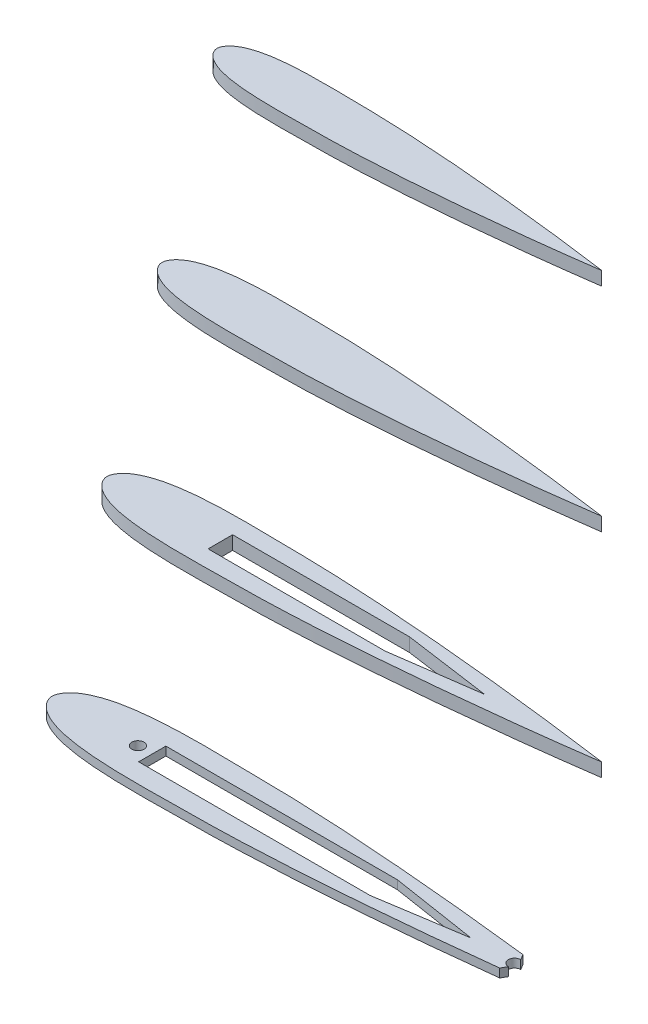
ISO-10303-21;
HEADER;
FILE_DESCRIPTION(('STEP AP214'),'2;1');
FILE_NAME('part.step','',(''),(''),'','','');
FILE_SCHEMA(('AUTOMOTIVE_DESIGN { 1 0 10303 214 1 1 1 1 }'));
ENDSEC;
DATA;
#1=APPLICATION_CONTEXT('core data for automotive mechanical design processes');
#2=APPLICATION_PROTOCOL_DEFINITION('international standard','automotive_design',2000,#1);
#3=PRODUCT_CONTEXT('',#1,'mechanical');
#4=PRODUCT('Part','Part','',(#3));
#5=PRODUCT_RELATED_PRODUCT_CATEGORY('part','',(#4));
#6=PRODUCT_DEFINITION_FORMATION('','',#4);
#7=PRODUCT_DEFINITION_CONTEXT('part definition',#1,'design');
#8=PRODUCT_DEFINITION('design','',#6,#7);
#9=PRODUCT_DEFINITION_SHAPE('','',#8);
#10=(LENGTH_UNIT() NAMED_UNIT(*) SI_UNIT(.MILLI.,.METRE.));
#11=(NAMED_UNIT(*) PLANE_ANGLE_UNIT() SI_UNIT($,.RADIAN.));
#12=(NAMED_UNIT(*) SI_UNIT($,.STERADIAN.) SOLID_ANGLE_UNIT());
#13=UNCERTAINTY_MEASURE_WITH_UNIT(LENGTH_MEASURE(1.E-05),#10,'distance_accuracy_value','');
#14=(GEOMETRIC_REPRESENTATION_CONTEXT(3) GLOBAL_UNCERTAINTY_ASSIGNED_CONTEXT((#13)) GLOBAL_UNIT_ASSIGNED_CONTEXT((#10,
#11,#12)) REPRESENTATION_CONTEXT('',''));
#15=CARTESIAN_POINT('',(0.,0.,0.));
#16=DIRECTION('',(0.,0.,1.));
#17=DIRECTION('',(1.,0.,0.));
#18=AXIS2_PLACEMENT_3D('',#15,#16,#17);
#19=CARTESIAN_POINT('',(-1.0449578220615,239.38,0.582550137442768));
#20=CARTESIAN_POINT('',(-3.78699073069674,239.38,0.204762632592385));
#21=CARTESIAN_POINT('',(-8.85873562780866,239.38,-0.499454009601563));
#22=CARTESIAN_POINT('',(-16.2695257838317,239.38,-1.4445777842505));
#23=CARTESIAN_POINT('',(-23.2696040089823,239.38,-2.29268146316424));
#24=CARTESIAN_POINT('',(-32.6001080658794,239.38,-3.35503543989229));
#25=CARTESIAN_POINT('',(-41.9336642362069,239.38,-4.32804564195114));
#26=CARTESIAN_POINT('',(-51.2700289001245,239.38,-5.20564022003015));
#27=CARTESIAN_POINT('',(-58.27017731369,239.38,-5.80750082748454));
#28=CARTESIAN_POINT('',(-65.270072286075,239.38,-6.35423268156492));
#29=CARTESIAN_POINT('',(-72.3167984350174,239.38,-6.8363461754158));
#30=CARTESIAN_POINT('',(-79.3633135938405,239.38,-7.24891768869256));
#31=CARTESIAN_POINT('',(-86.410576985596,239.38,-7.55438853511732));
#32=CARTESIAN_POINT('',(-93.411036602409,239.38,-7.78009668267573));
#33=CARTESIAN_POINT('',(-99.1996757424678,239.38,-7.77615190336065));
#34=CARTESIAN_POINT('',(-103.818969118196,239.38,-7.88372507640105));
#35=CARTESIAN_POINT('',(-109.605761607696,239.38,-7.96430560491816));
#36=CARTESIAN_POINT('',(-116.612118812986,239.38,-7.96783196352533));
#37=CARTESIAN_POINT('',(-123.617768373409,239.38,-7.59787723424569));
#38=CARTESIAN_POINT('',(-128.050302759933,239.38,-7.10443763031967));
#39=CARTESIAN_POINT('',(-131.089672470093,239.38,-6.60607404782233));
#40=CARTESIAN_POINT('',(-133.424901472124,239.38,-6.07463516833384));
#41=CARTESIAN_POINT('',(-135.286044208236,239.38,-5.51193863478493));
#42=CARTESIAN_POINT('',(-136.694702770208,239.38,-4.99709110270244));
#43=CARTESIAN_POINT('',(-138.111639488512,239.38,-4.35149801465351));
#44=CARTESIAN_POINT('',(-139.553669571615,239.38,-3.50558356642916));
#45=CARTESIAN_POINT('',(-140.749870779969,239.38,-2.51628774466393));
#46=CARTESIAN_POINT('',(-141.803380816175,239.38,-1.19207153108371));
#47=CARTESIAN_POINT('',(-142.578815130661,239.38,0.589694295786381));
#48=CARTESIAN_POINT('',(-141.803380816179,239.38,2.37146012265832));
#49=CARTESIAN_POINT('',(-140.749870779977,239.38,3.69567633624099));
#50=CARTESIAN_POINT('',(-139.553669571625,239.38,4.68497215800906));
#51=CARTESIAN_POINT('',(-138.111639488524,239.38,5.53088660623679));
#52=CARTESIAN_POINT('',(-136.694702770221,239.38,6.17647969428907));
#53=CARTESIAN_POINT('',(-135.28604420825,239.38,6.69132722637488));
#54=CARTESIAN_POINT('',(-133.42490147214,239.38,7.25402375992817));
#55=CARTESIAN_POINT('',(-131.08967247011,239.38,7.78546263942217));
#56=CARTESIAN_POINT('',(-128.050302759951,239.38,8.28382622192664));
#57=CARTESIAN_POINT('',(-123.617768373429,239.38,8.77726582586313));
#58=CARTESIAN_POINT('',(-116.612118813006,239.38,9.14722055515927));
#59=CARTESIAN_POINT('',(-109.605761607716,239.38,9.1436941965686));
#60=CARTESIAN_POINT('',(-103.818969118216,239.38,9.06311366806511));
#61=CARTESIAN_POINT('',(-99.1996757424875,239.38,8.95554049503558));
#62=CARTESIAN_POINT('',(-93.4110366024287,239.38,8.95948527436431));
#63=CARTESIAN_POINT('',(-86.4105769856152,239.38,8.73377712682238));
#64=CARTESIAN_POINT('',(-79.3633135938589,239.38,8.42830628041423));
#65=CARTESIAN_POINT('',(-72.3167984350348,239.38,8.01573476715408));
#66=CARTESIAN_POINT('',(-65.2700722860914,239.38,7.53362127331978));
#67=CARTESIAN_POINT('',(-58.2701773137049,239.38,6.98688941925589));
#68=CARTESIAN_POINT('',(-51.2700289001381,239.38,6.38502881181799));
#69=CARTESIAN_POINT('',(-41.9336642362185,239.38,5.50743423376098));
#70=CARTESIAN_POINT('',(-32.6001080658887,239.38,4.5344240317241));
#71=CARTESIAN_POINT('',(-23.2696040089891,239.38,3.47207005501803));
#72=CARTESIAN_POINT('',(-16.2695257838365,239.38,2.62396637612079));
#73=CARTESIAN_POINT('',(-8.85244286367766,239.38,1.67804006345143));
#74=CARTESIAN_POINT('',(-3.77442390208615,239.38,0.972880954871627));
#75=CARTESIAN_POINT('',(-1.02610489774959,239.38,0.594241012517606));
#76=B_SPLINE_CURVE_WITH_KNOTS('',3,(#19,#20,#21,#22,#23,#24,#25,#26,#27,#28,#29,#30,#31,#32,#33,
#34,#35,#36,#37,#38,#39,#40,#41,#42,#43,#44,#45,#46,#47,#48,#49,#50,#51,#52,#53,#54,#55,#56,#57,
#58,#59,#60,#61,#62,#63,#64,#65,#66,#67,#68,#69,#70,#71,#72,#73,#74,#75),.UNSPECIFIED.,.F.,.F.,
(4,1,1,1,1,1,1,1,1,1,1,1,1,1,1,1,1,1,1,1,1,1,1,1,1,1,1,1,1,1,1,1,1,1,1,1,1,1,1,1,1,1,1,1,1,1,1,
1,1,1,1,1,1,1,4),(-0.00432084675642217,0.0246342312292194,0.0492428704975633,0.0738297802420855,
0.0983967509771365,0.147478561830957,0.171994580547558,0.196493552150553,0.220976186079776,
0.245442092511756,0.270380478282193,0.29481296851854,0.319231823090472,0.343641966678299,
0.355360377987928,0.367566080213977,0.404182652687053,0.428636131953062,0.440920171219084,
0.450818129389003,0.460843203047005,0.465945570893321,0.471149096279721,0.476522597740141,
0.482208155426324,0.488618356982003,0.492567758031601,0.5,0.507432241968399,0.511381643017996,
0.517791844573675,0.523477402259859,0.528850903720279,0.534054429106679,0.539156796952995,
0.549181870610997,0.559079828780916,0.571363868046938,0.595817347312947,0.632433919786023,
0.644639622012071,0.656358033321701,0.680768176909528,0.70518703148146,0.729619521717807,
0.754557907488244,0.779023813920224,0.803506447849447,0.828005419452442,0.852521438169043,
0.901603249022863,0.926170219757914,0.950757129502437,0.975365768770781,1.00438720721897),.UNSPECIFIED.);
#77=DIRECTION('',(0.,-1.,0.));
#78=VECTOR('',#77,1.);
#79=SURFACE_OF_LINEAR_EXTRUSION('',#76,#78);
#80=CARTESIAN_POINT('',(-1.0449578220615,234.38,0.582550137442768));
#81=CARTESIAN_POINT('',(-3.78699073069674,234.38,0.204762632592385));
#82=CARTESIAN_POINT('',(-8.85873562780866,234.38,-0.499454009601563));
#83=CARTESIAN_POINT('',(-16.2695257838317,234.38,-1.4445777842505));
#84=CARTESIAN_POINT('',(-23.2696040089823,234.38,-2.29268146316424));
#85=CARTESIAN_POINT('',(-32.6001080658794,234.38,-3.35503543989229));
#86=CARTESIAN_POINT('',(-41.9336642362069,234.38,-4.32804564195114));
#87=CARTESIAN_POINT('',(-51.2700289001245,234.38,-5.20564022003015));
#88=CARTESIAN_POINT('',(-58.27017731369,234.38,-5.80750082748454));
#89=CARTESIAN_POINT('',(-65.270072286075,234.38,-6.35423268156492));
#90=CARTESIAN_POINT('',(-72.3167984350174,234.38,-6.8363461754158));
#91=CARTESIAN_POINT('',(-79.3633135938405,234.38,-7.24891768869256));
#92=CARTESIAN_POINT('',(-86.410576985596,234.38,-7.55438853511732));
#93=CARTESIAN_POINT('',(-93.411036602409,234.38,-7.78009668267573));
#94=CARTESIAN_POINT('',(-99.1996757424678,234.38,-7.77615190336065));
#95=CARTESIAN_POINT('',(-103.818969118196,234.38,-7.88372507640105));
#96=CARTESIAN_POINT('',(-109.605761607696,234.38,-7.96430560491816));
#97=CARTESIAN_POINT('',(-116.612118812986,234.38,-7.96783196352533));
#98=CARTESIAN_POINT('',(-123.617768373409,234.38,-7.59787723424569));
#99=CARTESIAN_POINT('',(-128.050302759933,234.38,-7.10443763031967));
#100=CARTESIAN_POINT('',(-131.089672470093,234.38,-6.60607404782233));
#101=CARTESIAN_POINT('',(-133.424901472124,234.38,-6.07463516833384));
#102=CARTESIAN_POINT('',(-135.286044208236,234.38,-5.51193863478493));
#103=CARTESIAN_POINT('',(-136.694702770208,234.38,-4.99709110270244));
#104=CARTESIAN_POINT('',(-138.111639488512,234.38,-4.35149801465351));
#105=CARTESIAN_POINT('',(-139.553669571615,234.38,-3.50558356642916));
#106=CARTESIAN_POINT('',(-140.749870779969,234.38,-2.51628774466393));
#107=CARTESIAN_POINT('',(-141.803380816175,234.38,-1.19207153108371));
#108=CARTESIAN_POINT('',(-142.578815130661,234.38,0.589694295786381));
#109=CARTESIAN_POINT('',(-141.803380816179,234.38,2.37146012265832));
#110=CARTESIAN_POINT('',(-140.749870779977,234.38,3.69567633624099));
#111=CARTESIAN_POINT('',(-139.553669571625,234.38,4.68497215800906));
#112=CARTESIAN_POINT('',(-138.111639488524,234.38,5.53088660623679));
#113=CARTESIAN_POINT('',(-136.694702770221,234.38,6.17647969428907));
#114=CARTESIAN_POINT('',(-135.28604420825,234.38,6.69132722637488));
#115=CARTESIAN_POINT('',(-133.42490147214,234.38,7.25402375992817));
#116=CARTESIAN_POINT('',(-131.08967247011,234.38,7.78546263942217));
#117=CARTESIAN_POINT('',(-128.050302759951,234.38,8.28382622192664));
#118=CARTESIAN_POINT('',(-123.617768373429,234.38,8.77726582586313));
#119=CARTESIAN_POINT('',(-116.612118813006,234.38,9.14722055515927));
#120=CARTESIAN_POINT('',(-109.605761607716,234.38,9.1436941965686));
#121=CARTESIAN_POINT('',(-103.818969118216,234.38,9.06311366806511));
#122=CARTESIAN_POINT('',(-99.1996757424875,234.38,8.95554049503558));
#123=CARTESIAN_POINT('',(-93.4110366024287,234.38,8.95948527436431));
#124=CARTESIAN_POINT('',(-86.4105769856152,234.38,8.73377712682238));
#125=CARTESIAN_POINT('',(-79.3633135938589,234.38,8.42830628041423));
#126=CARTESIAN_POINT('',(-72.3167984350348,234.38,8.01573476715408));
#127=CARTESIAN_POINT('',(-65.2700722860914,234.38,7.53362127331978));
#128=CARTESIAN_POINT('',(-58.2701773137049,234.38,6.98688941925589));
#129=CARTESIAN_POINT('',(-51.2700289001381,234.38,6.38502881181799));
#130=CARTESIAN_POINT('',(-41.9336642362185,234.38,5.50743423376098));
#131=CARTESIAN_POINT('',(-32.6001080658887,234.38,4.5344240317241));
#132=CARTESIAN_POINT('',(-23.2696040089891,234.38,3.47207005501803));
#133=CARTESIAN_POINT('',(-16.2695257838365,234.38,2.62396637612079));
#134=CARTESIAN_POINT('',(-8.85244286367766,234.38,1.67804006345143));
#135=CARTESIAN_POINT('',(-3.77442390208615,234.38,0.972880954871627));
#136=CARTESIAN_POINT('',(-1.02610489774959,234.38,0.594241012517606));
#137=B_SPLINE_CURVE_WITH_KNOTS('',3,(#80,#81,#82,#83,#84,#85,#86,#87,#88,#89,#90,#91,#92,#93,
#94,#95,#96,#97,#98,#99,#100,#101,#102,#103,#104,#105,#106,#107,#108,#109,#110,#111,#112,#113,
#114,#115,#116,#117,#118,#119,#120,#121,#122,#123,#124,#125,#126,#127,#128,#129,#130,#131,#132,
#133,#134,#135,#136),.UNSPECIFIED.,.F.,.F.,(4,1,1,1,1,1,1,1,1,1,1,1,1,1,1,1,1,1,1,1,1,1,1,1,1,1,
1,1,1,1,1,1,1,1,1,1,1,1,1,1,1,1,1,1,1,1,1,1,1,1,1,1,1,1,4),(-0.00432084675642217,
0.0246342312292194,0.0492428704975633,0.0738297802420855,0.0983967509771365,0.147478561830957,
0.171994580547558,0.196493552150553,0.220976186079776,0.245442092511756,0.270380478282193,
0.29481296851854,0.319231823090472,0.343641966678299,0.355360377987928,0.367566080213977,
0.404182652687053,0.428636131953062,0.440920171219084,0.450818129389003,0.460843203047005,
0.465945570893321,0.471149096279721,0.476522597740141,0.482208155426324,0.488618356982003,
0.492567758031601,0.5,0.507432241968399,0.511381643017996,0.517791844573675,0.523477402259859,
0.528850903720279,0.534054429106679,0.539156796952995,0.549181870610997,0.559079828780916,
0.571363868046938,0.595817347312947,0.632433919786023,0.644639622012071,0.656358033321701,
0.680768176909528,0.70518703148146,0.729619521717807,0.754557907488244,0.779023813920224,
0.803506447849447,0.828005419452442,0.852521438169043,0.901603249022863,0.926170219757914,
0.950757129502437,0.975365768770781,1.00438720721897),.UNSPECIFIED.);
#138=CARTESIAN_POINT('',(-1.0449578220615,234.38,0.582550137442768));
#139=VERTEX_POINT('',#138);
#140=CARTESIAN_POINT('',(-1.02610489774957,234.38,0.594241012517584));
#141=VERTEX_POINT('',#140);
#142=EDGE_CURVE('E84',#139,#141,#137,.T.);
#143=ORIENTED_EDGE('',*,*,#142,.T.);
#144=DIRECTION('',(0.,-1.,0.));
#145=VECTOR('',#144,1.);
#146=CARTESIAN_POINT('',(-1.02610489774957,239.38,0.594241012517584));
#147=LINE('',#146,#145);
#148=CARTESIAN_POINT('',(-1.02610489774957,239.38,0.594241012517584));
#149=VERTEX_POINT('',#148);
#150=EDGE_CURVE('E12',#149,#141,#147,.T.);
#151=ORIENTED_EDGE('',*,*,#150,.F.);
#152=CARTESIAN_POINT('',(-1.0449578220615,239.38,0.582550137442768));
#153=VERTEX_POINT('',#152);
#154=EDGE_CURVE('E86',#153,#149,#76,.T.);
#155=ORIENTED_EDGE('',*,*,#154,.F.);
#156=DIRECTION('',(0.,-1.,0.));
#157=VECTOR('',#156,1.);
#158=CARTESIAN_POINT('',(-1.0449578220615,239.38,0.582550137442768));
#159=LINE('',#158,#157);
#160=EDGE_CURVE('E68',#153,#139,#159,.T.);
#161=ORIENTED_EDGE('',*,*,#160,.T.);
#162=EDGE_LOOP('',(#143,#151,#155,#161));
#163=FACE_BOUND('',#162,.T.);
#164=ADVANCED_FACE('F58',(#163),#79,.F.);
#165=CARTESIAN_POINT('',(-1.0449578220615,239.38,0.582550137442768));
#166=DIRECTION('',(0.527006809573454,0.,-0.849861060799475));
#167=DIRECTION('',(-0.849861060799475,0.,-0.527006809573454));
#168=AXIS2_PLACEMENT_3D('',#165,#166,#167);
#169=PLANE('',#168);
#170=DIRECTION('',(0.849861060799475,0.,0.527006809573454));
#171=VECTOR('',#170,1.);
#172=CARTESIAN_POINT('',(-1.0449578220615,234.38,0.582550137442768));
#173=LINE('',#172,#171);
#174=EDGE_CURVE('E92',#139,#141,#173,.T.);
#175=ORIENTED_EDGE('',*,*,#174,.F.);
#176=ORIENTED_EDGE('',*,*,#160,.F.);
#177=DIRECTION('',(0.849861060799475,0.,0.527006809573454));
#178=VECTOR('',#177,1.);
#179=CARTESIAN_POINT('',(-1.0449578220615,239.38,0.582550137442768));
#180=LINE('',#179,#178);
#181=EDGE_CURVE('E89',#153,#149,#180,.T.);
#182=ORIENTED_EDGE('',*,*,#181,.T.);
#183=ORIENTED_EDGE('',*,*,#150,.T.);
#184=EDGE_LOOP('',(#175,#176,#182,#183));
#185=FACE_BOUND('',#184,.T.);
#186=ADVANCED_FACE('F95',(#185),#169,.T.);
#187=CARTESIAN_POINT('',(-142.272469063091,239.38,0.599121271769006));
#188=DIRECTION('',(0.,1.,0.));
#189=DIRECTION('',(0.,0.,1.));
#190=AXIS2_PLACEMENT_3D('',#187,#188,#189);
#191=PLANE('',#190);
#192=ORIENTED_EDGE('',*,*,#154,.T.);
#193=ORIENTED_EDGE('',*,*,#181,.F.);
#194=EDGE_LOOP('',(#192,#193));
#195=FACE_BOUND('',#194,.T.);
#196=ADVANCED_FACE('F115',(#195),#191,.T.);
#197=CARTESIAN_POINT('',(-142.272469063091,234.38,0.599121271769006));
#198=DIRECTION('',(0.,1.,0.));
#199=DIRECTION('',(0.,0.,1.));
#200=AXIS2_PLACEMENT_3D('',#197,#198,#199);
#201=PLANE('',#200);
#202=ORIENTED_EDGE('',*,*,#142,.F.);
#203=ORIENTED_EDGE('',*,*,#174,.T.);
#204=EDGE_LOOP('',(#202,#203));
#205=FACE_BOUND('',#204,.T.);
#206=ADVANCED_FACE('F91',(#205),#201,.F.);
#207=CLOSED_SHELL('',(#164,#186,#196,#206));
#208=MANIFOLD_SOLID_BREP('B2_NOT_SHOWN',#207);
#209=CARTESIAN_POINT('',(-1.0449578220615,161.252,0.582550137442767));
#210=CARTESIAN_POINT('',(-4.17870971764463,161.252,0.150792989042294));
#211=CARTESIAN_POINT('',(-9.97498960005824,161.252,-0.654026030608));
#212=CARTESIAN_POINT('',(-18.4444640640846,161.252,-1.73416748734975));
#213=CARTESIAN_POINT('',(-26.4445534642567,161.252,-2.70342883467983));
#214=CARTESIAN_POINT('',(-37.107986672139,161.252,-3.91754766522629));
#215=CARTESIAN_POINT('',(-47.7749080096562,161.252,-5.02955932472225));
#216=CARTESIAN_POINT('',(-58.4450390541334,161.252,-6.03252455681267));
#217=CARTESIAN_POINT('',(-66.4452086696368,161.252,-6.72036525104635));
#218=CARTESIAN_POINT('',(-74.4450886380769,161.252,-7.34520165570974));
#219=CARTESIAN_POINT('',(-82.4984899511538,161.252,-7.89618850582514));
#220=CARTESIAN_POINT('',(-90.5516501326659,161.252,-8.36769880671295));
#221=CARTESIAN_POINT('',(-98.6056654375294,161.252,-8.7168083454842));
#222=CARTESIAN_POINT('',(-106.606190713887,161.252,-8.97476051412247));
#223=CARTESIAN_POINT('',(-113.221778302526,161.252,-8.97025219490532));
#224=CARTESIAN_POINT('',(-118.500970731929,161.252,-9.09319296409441));
#225=CARTESIAN_POINT('',(-125.114447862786,161.252,-9.18528499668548));
#226=CARTESIAN_POINT('',(-133.121713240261,161.252,-9.18931512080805));
#227=CARTESIAN_POINT('',(-141.128169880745,161.252,-8.76650971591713));
#228=CARTESIAN_POINT('',(-146.193923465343,161.252,-8.20257874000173));
#229=CARTESIAN_POINT('',(-149.667488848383,161.252,-7.63302036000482));
#230=CARTESIAN_POINT('',(-152.336321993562,161.252,-7.02566164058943));
#231=CARTESIAN_POINT('',(-154.463342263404,161.252,-6.38257988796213));
#232=CARTESIAN_POINT('',(-156.0732377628,161.252,-5.7941827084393));
#233=CARTESIAN_POINT('',(-157.69259401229,161.252,-5.0563620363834));
#234=CARTESIAN_POINT('',(-159.34062839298,161.252,-4.08960266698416));
#235=CARTESIAN_POINT('',(-160.707715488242,161.252,-2.95897887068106));
#236=CARTESIAN_POINT('',(-161.911726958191,161.252,-1.44558891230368));
#237=CARTESIAN_POINT('',(-162.797937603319,161.252,0.590714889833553));
#238=CARTESIAN_POINT('',(-161.911726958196,161.252,2.62701869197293));
#239=CARTESIAN_POINT('',(-160.70771548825,161.252,4.14040865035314));
#240=CARTESIAN_POINT('',(-159.340628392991,161.252,5.27103244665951));
#241=CARTESIAN_POINT('',(-157.692594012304,161.252,6.23779181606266));
#242=CARTESIAN_POINT('',(-156.073237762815,161.252,6.97561248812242));
#243=CARTESIAN_POINT('',(-154.46334226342,161.252,7.56400966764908));
#244=CARTESIAN_POINT('',(-152.33632199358,161.252,8.20709142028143));
#245=CARTESIAN_POINT('',(-149.667488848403,161.252,8.81445013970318));
#246=CARTESIAN_POINT('',(-146.193923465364,161.252,9.38400851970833));
#247=CARTESIAN_POINT('',(-141.128169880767,161.252,9.9479394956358));
#248=CARTESIAN_POINT('',(-133.121713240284,161.252,10.3707449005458));
#249=CARTESIAN_POINT('',(-125.11444786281,161.252,10.3667147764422));
#250=CARTESIAN_POINT('',(-118.500970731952,161.252,10.2746227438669));
#251=CARTESIAN_POINT('',(-113.221778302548,161.252,10.1516819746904));
#252=CARTESIAN_POINT('',(-106.60619071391,161.252,10.1561902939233));
#253=CARTESIAN_POINT('',(-98.6056654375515,161.252,9.89823812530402));
#254=CARTESIAN_POINT('',(-90.5516501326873,161.252,9.54912858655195));
#255=CARTESIAN_POINT('',(-82.4984899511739,161.252,9.07761828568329));
#256=CARTESIAN_POINT('',(-74.4450886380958,161.252,8.52663143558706));
#257=CARTESIAN_POINT('',(-66.4452086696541,161.252,7.90179503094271));
#258=CARTESIAN_POINT('',(-58.4450390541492,161.252,7.21395433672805));
#259=CARTESIAN_POINT('',(-47.7749080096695,161.252,6.21098910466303));
#260=CARTESIAN_POINT('',(-37.1079866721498,161.252,5.09897744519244));
#261=CARTESIAN_POINT('',(-26.4445534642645,161.252,3.88485861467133));
#262=CARTESIAN_POINT('',(-18.4444640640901,161.252,2.9155972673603));
#263=CARTESIAN_POINT('',(-9.96779786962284,161.252,1.83453862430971));
#264=CARTESIAN_POINT('',(-4.16434762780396,161.252,1.02864250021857));
#265=CARTESIAN_POINT('',(-1.02341162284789,161.252,0.595911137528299));
#266=B_SPLINE_CURVE_WITH_KNOTS('',3,(#209,#210,#211,#212,#213,#214,#215,#216,#217,#218,#219,
#220,#221,#222,#223,#224,#225,#226,#227,#228,#229,#230,#231,#232,#233,#234,#235,#236,#237,#238,
#239,#240,#241,#242,#243,#244,#245,#246,#247,#248,#249,#250,#251,#252,#253,#254,#255,#256,#257,
#258,#259,#260,#261,#262,#263,#264,#265),.UNSPECIFIED.,.F.,.F.,(4,1,1,1,1,1,1,1,1,1,1,1,1,1,1,1,
1,1,1,1,1,1,1,1,1,1,1,1,1,1,1,1,1,1,1,1,1,1,1,1,1,1,1,1,1,1,1,1,1,1,1,1,1,1,4),
(-0.00432084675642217,0.0246342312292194,0.0492428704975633,0.0738297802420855,
0.0983967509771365,0.147478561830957,0.171994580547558,0.196493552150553,0.220976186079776,
0.245442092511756,0.270380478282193,0.29481296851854,0.319231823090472,0.343641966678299,
0.355360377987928,0.367566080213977,0.404182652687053,0.428636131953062,0.440920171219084,
0.450818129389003,0.460843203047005,0.465945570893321,0.471149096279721,0.476522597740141,
0.482208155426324,0.488618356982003,0.492567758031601,0.5,0.507432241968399,0.511381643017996,
0.517791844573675,0.523477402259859,0.528850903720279,0.534054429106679,0.539156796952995,
0.549181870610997,0.559079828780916,0.571363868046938,0.595817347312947,0.632433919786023,
0.644639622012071,0.656358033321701,0.680768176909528,0.70518703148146,0.729619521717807,
0.754557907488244,0.779023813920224,0.803506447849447,0.828005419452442,0.852521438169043,
0.901603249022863,0.926170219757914,0.950757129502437,0.975365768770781,1.00438720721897),.UNSPECIFIED.);
#267=DIRECTION('',(0.,-1.,0.));
#268=VECTOR('',#267,1.);
#269=SURFACE_OF_LINEAR_EXTRUSION('',#266,#268);
#270=CARTESIAN_POINT('',(-1.0449578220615,156.252,0.582550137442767));
#271=CARTESIAN_POINT('',(-4.17870971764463,156.252,0.150792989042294));
#272=CARTESIAN_POINT('',(-9.97498960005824,156.252,-0.654026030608));
#273=CARTESIAN_POINT('',(-18.4444640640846,156.252,-1.73416748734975));
#274=CARTESIAN_POINT('',(-26.4445534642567,156.252,-2.70342883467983));
#275=CARTESIAN_POINT('',(-37.107986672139,156.252,-3.91754766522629));
#276=CARTESIAN_POINT('',(-47.7749080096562,156.252,-5.02955932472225));
#277=CARTESIAN_POINT('',(-58.4450390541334,156.252,-6.03252455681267));
#278=CARTESIAN_POINT('',(-66.4452086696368,156.252,-6.72036525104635));
#279=CARTESIAN_POINT('',(-74.4450886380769,156.252,-7.34520165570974));
#280=CARTESIAN_POINT('',(-82.4984899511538,156.252,-7.89618850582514));
#281=CARTESIAN_POINT('',(-90.5516501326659,156.252,-8.36769880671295));
#282=CARTESIAN_POINT('',(-98.6056654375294,156.252,-8.7168083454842));
#283=CARTESIAN_POINT('',(-106.606190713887,156.252,-8.97476051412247));
#284=CARTESIAN_POINT('',(-113.221778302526,156.252,-8.97025219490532));
#285=CARTESIAN_POINT('',(-118.500970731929,156.252,-9.09319296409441));
#286=CARTESIAN_POINT('',(-125.114447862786,156.252,-9.18528499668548));
#287=CARTESIAN_POINT('',(-133.121713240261,156.252,-9.18931512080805));
#288=CARTESIAN_POINT('',(-141.128169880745,156.252,-8.76650971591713));
#289=CARTESIAN_POINT('',(-146.193923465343,156.252,-8.20257874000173));
#290=CARTESIAN_POINT('',(-149.667488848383,156.252,-7.63302036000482));
#291=CARTESIAN_POINT('',(-152.336321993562,156.252,-7.02566164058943));
#292=CARTESIAN_POINT('',(-154.463342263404,156.252,-6.38257988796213));
#293=CARTESIAN_POINT('',(-156.0732377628,156.252,-5.7941827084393));
#294=CARTESIAN_POINT('',(-157.69259401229,156.252,-5.0563620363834));
#295=CARTESIAN_POINT('',(-159.34062839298,156.252,-4.08960266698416));
#296=CARTESIAN_POINT('',(-160.707715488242,156.252,-2.95897887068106));
#297=CARTESIAN_POINT('',(-161.911726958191,156.252,-1.44558891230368));
#298=CARTESIAN_POINT('',(-162.797937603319,156.252,0.590714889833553));
#299=CARTESIAN_POINT('',(-161.911726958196,156.252,2.62701869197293));
#300=CARTESIAN_POINT('',(-160.70771548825,156.252,4.14040865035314));
#301=CARTESIAN_POINT('',(-159.340628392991,156.252,5.27103244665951));
#302=CARTESIAN_POINT('',(-157.692594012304,156.252,6.23779181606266));
#303=CARTESIAN_POINT('',(-156.073237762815,156.252,6.97561248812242));
#304=CARTESIAN_POINT('',(-154.46334226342,156.252,7.56400966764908));
#305=CARTESIAN_POINT('',(-152.33632199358,156.252,8.20709142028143));
#306=CARTESIAN_POINT('',(-149.667488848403,156.252,8.81445013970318));
#307=CARTESIAN_POINT('',(-146.193923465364,156.252,9.38400851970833));
#308=CARTESIAN_POINT('',(-141.128169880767,156.252,9.9479394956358));
#309=CARTESIAN_POINT('',(-133.121713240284,156.252,10.3707449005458));
#310=CARTESIAN_POINT('',(-125.11444786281,156.252,10.3667147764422));
#311=CARTESIAN_POINT('',(-118.500970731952,156.252,10.2746227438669));
#312=CARTESIAN_POINT('',(-113.221778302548,156.252,10.1516819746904));
#313=CARTESIAN_POINT('',(-106.60619071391,156.252,10.1561902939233));
#314=CARTESIAN_POINT('',(-98.6056654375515,156.252,9.89823812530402));
#315=CARTESIAN_POINT('',(-90.5516501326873,156.252,9.54912858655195));
#316=CARTESIAN_POINT('',(-82.4984899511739,156.252,9.07761828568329));
#317=CARTESIAN_POINT('',(-74.4450886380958,156.252,8.52663143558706));
#318=CARTESIAN_POINT('',(-66.4452086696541,156.252,7.90179503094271));
#319=CARTESIAN_POINT('',(-58.4450390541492,156.252,7.21395433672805));
#320=CARTESIAN_POINT('',(-47.7749080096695,156.252,6.21098910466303));
#321=CARTESIAN_POINT('',(-37.1079866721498,156.252,5.09897744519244));
#322=CARTESIAN_POINT('',(-26.4445534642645,156.252,3.88485861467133));
#323=CARTESIAN_POINT('',(-18.4444640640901,156.252,2.9155972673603));
#324=CARTESIAN_POINT('',(-9.96779786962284,156.252,1.83453862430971));
#325=CARTESIAN_POINT('',(-4.16434762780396,156.252,1.02864250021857));
#326=CARTESIAN_POINT('',(-1.02341162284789,156.252,0.595911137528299));
#327=B_SPLINE_CURVE_WITH_KNOTS('',3,(#270,#271,#272,#273,#274,#275,#276,#277,#278,#279,#280,
#281,#282,#283,#284,#285,#286,#287,#288,#289,#290,#291,#292,#293,#294,#295,#296,#297,#298,#299,
#300,#301,#302,#303,#304,#305,#306,#307,#308,#309,#310,#311,#312,#313,#314,#315,#316,#317,#318,
#319,#320,#321,#322,#323,#324,#325,#326),.UNSPECIFIED.,.F.,.F.,(4,1,1,1,1,1,1,1,1,1,1,1,1,1,1,1,
1,1,1,1,1,1,1,1,1,1,1,1,1,1,1,1,1,1,1,1,1,1,1,1,1,1,1,1,1,1,1,1,1,1,1,1,1,1,4),
(-0.00432084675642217,0.0246342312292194,0.0492428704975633,0.0738297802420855,
0.0983967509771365,0.147478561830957,0.171994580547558,0.196493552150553,0.220976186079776,
0.245442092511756,0.270380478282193,0.29481296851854,0.319231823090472,0.343641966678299,
0.355360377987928,0.367566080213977,0.404182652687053,0.428636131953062,0.440920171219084,
0.450818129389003,0.460843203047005,0.465945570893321,0.471149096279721,0.476522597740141,
0.482208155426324,0.488618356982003,0.492567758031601,0.5,0.507432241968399,0.511381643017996,
0.517791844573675,0.523477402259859,0.528850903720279,0.534054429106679,0.539156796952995,
0.549181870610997,0.559079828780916,0.571363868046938,0.595817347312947,0.632433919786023,
0.644639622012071,0.656358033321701,0.680768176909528,0.70518703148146,0.729619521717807,
0.754557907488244,0.779023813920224,0.803506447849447,0.828005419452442,0.852521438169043,
0.901603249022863,0.926170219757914,0.950757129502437,0.975365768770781,1.00438720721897),.UNSPECIFIED.);
#328=CARTESIAN_POINT('',(-1.0449578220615,156.252,0.582550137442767));
#329=VERTEX_POINT('',#328);
#330=CARTESIAN_POINT('',(-1.02341162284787,156.252,0.595911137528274));
#331=VERTEX_POINT('',#330);
#332=EDGE_CURVE('E189',#329,#331,#327,.T.);
#333=ORIENTED_EDGE('',*,*,#332,.T.);
#334=DIRECTION('',(0.,-1.,0.));
#335=VECTOR('',#334,1.);
#336=CARTESIAN_POINT('',(-1.02341162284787,161.252,0.595911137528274));
#337=LINE('',#336,#335);
#338=CARTESIAN_POINT('',(-1.02341162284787,161.252,0.595911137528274));
#339=VERTEX_POINT('',#338);
#340=EDGE_CURVE('E56',#339,#331,#337,.T.);
#341=ORIENTED_EDGE('',*,*,#340,.F.);
#342=CARTESIAN_POINT('',(-1.0449578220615,161.252,0.582550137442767));
#343=VERTEX_POINT('',#342);
#344=EDGE_CURVE('E191',#343,#339,#266,.T.);
#345=ORIENTED_EDGE('',*,*,#344,.F.);
#346=DIRECTION('',(0.,-1.,0.));
#347=VECTOR('',#346,1.);
#348=CARTESIAN_POINT('',(-1.0449578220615,161.252,0.582550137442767));
#349=LINE('',#348,#347);
#350=EDGE_CURVE('E173',#343,#329,#349,.T.);
#351=ORIENTED_EDGE('',*,*,#350,.T.);
#352=EDGE_LOOP('',(#333,#341,#345,#351));
#353=FACE_BOUND('',#352,.T.);
#354=ADVANCED_FACE('F163',(#353),#269,.F.);
#355=CARTESIAN_POINT('',(-1.0449578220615,161.252,0.582550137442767));
#356=DIRECTION('',(0.527006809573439,0.,-0.849861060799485));
#357=DIRECTION('',(-0.849861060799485,0.,-0.527006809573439));
#358=AXIS2_PLACEMENT_3D('',#355,#356,#357);
#359=PLANE('',#358);
#360=DIRECTION('',(0.849861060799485,0.,0.527006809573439));
#361=VECTOR('',#360,1.);
#362=CARTESIAN_POINT('',(-1.0449578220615,156.252,0.582550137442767));
#363=LINE('',#362,#361);
#364=EDGE_CURVE('E197',#329,#331,#363,.T.);
#365=ORIENTED_EDGE('',*,*,#364,.F.);
#366=ORIENTED_EDGE('',*,*,#350,.F.);
#367=DIRECTION('',(0.849861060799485,0.,0.527006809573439));
#368=VECTOR('',#367,1.);
#369=CARTESIAN_POINT('',(-1.0449578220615,161.252,0.582550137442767));
#370=LINE('',#369,#368);
#371=EDGE_CURVE('E194',#343,#339,#370,.T.);
#372=ORIENTED_EDGE('',*,*,#371,.T.);
#373=ORIENTED_EDGE('',*,*,#340,.T.);
#374=EDGE_LOOP('',(#365,#366,#372,#373));
#375=FACE_BOUND('',#374,.T.);
#376=ADVANCED_FACE('F200',(#375),#359,.T.);
#377=CARTESIAN_POINT('',(-162.447827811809,161.252,0.601488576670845));
#378=DIRECTION('',(0.,1.,0.));
#379=DIRECTION('',(0.,0.,1.));
#380=AXIS2_PLACEMENT_3D('',#377,#378,#379);
#381=PLANE('',#380);
#382=ORIENTED_EDGE('',*,*,#344,.T.);
#383=ORIENTED_EDGE('',*,*,#371,.F.);
#384=EDGE_LOOP('',(#382,#383));
#385=FACE_BOUND('',#384,.T.);
#386=ADVANCED_FACE('F220',(#385),#381,.T.);
#387=CARTESIAN_POINT('',(-162.447827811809,156.252,0.601488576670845));
#388=DIRECTION('',(0.,1.,0.));
#389=DIRECTION('',(0.,0.,1.));
#390=AXIS2_PLACEMENT_3D('',#387,#388,#389);
#391=PLANE('',#390);
#392=ORIENTED_EDGE('',*,*,#332,.F.);
#393=ORIENTED_EDGE('',*,*,#364,.T.);
#394=EDGE_LOOP('',(#392,#393));
#395=FACE_BOUND('',#394,.T.);
#396=ADVANCED_FACE('F196',(#395),#391,.F.);
#397=CLOSED_SHELL('',(#354,#376,#386,#396));
#398=MANIFOLD_SOLID_BREP('B6_NOT_SHOWN',#397);
#399=CARTESIAN_POINT('',(-182.623186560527,83.126,0.603855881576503));
#400=DIRECTION('',(0.,1.,0.));
#401=DIRECTION('',(0.,0.,1.));
#402=AXIS2_PLACEMENT_3D('',#399,#400,#401);
#403=PLANE('',#402);
#404=CARTESIAN_POINT('',(-1.0449578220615,83.126,0.582550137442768));
#405=CARTESIAN_POINT('',(-4.57042870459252,83.126,0.0968233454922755));
#406=CARTESIAN_POINT('',(-11.0912435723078,83.126,-0.808598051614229));
#407=CARTESIAN_POINT('',(-20.6194023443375,83.126,-2.02375719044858));
#408=CARTESIAN_POINT('',(-29.6195029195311,83.126,-3.11417620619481));
#409=CARTESIAN_POINT('',(-41.6158652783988,83.126,-4.48005989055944));
#410=CARTESIAN_POINT('',(-53.6161517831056,83.126,-5.73107300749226));
#411=CARTESIAN_POINT('',(-65.6200492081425,83.126,-6.85940889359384));
#412=CARTESIAN_POINT('',(-74.6202400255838,83.126,-7.63322967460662));
#413=CARTESIAN_POINT('',(-83.6201049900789,83.126,-8.33617062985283));
#414=CARTESIAN_POINT('',(-92.6801814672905,83.126,-8.95603083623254));
#415=CARTESIAN_POINT('',(-101.739986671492,83.126,-9.48647992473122));
#416=CARTESIAN_POINT('',(-110.800753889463,83.126,-9.87922815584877));
#417=CARTESIAN_POINT('',(-119.801344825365,83.126,-10.1694243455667));
#418=CARTESIAN_POINT('',(-127.243880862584,83.126,-10.1643524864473));
#419=CARTESIAN_POINT('',(-133.182972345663,83.126,-10.302660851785));
#420=CARTESIAN_POINT('',(-140.623134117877,83.126,-10.4062643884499));
#421=CARTESIAN_POINT('',(-149.631307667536,83.126,-10.4107982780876));
#422=CARTESIAN_POINT('',(-158.63857138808,83.126,-9.93514219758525));
#423=CARTESIAN_POINT('',(-164.337544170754,83.126,-9.30071984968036));
#424=CARTESIAN_POINT('',(-168.245305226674,83.126,-8.65996667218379));
#425=CARTESIAN_POINT('',(-171.247742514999,83.126,-7.97668811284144));
#426=CARTESIAN_POINT('',(-173.640640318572,83.126,-7.2532211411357));
#427=CARTESIAN_POINT('',(-175.451772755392,83.126,-6.59127431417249));
#428=CARTESIAN_POINT('',(-177.273548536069,83.126,-5.76122605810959));
#429=CARTESIAN_POINT('',(-179.127587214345,83.126,-4.67362176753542));
#430=CARTESIAN_POINT('',(-180.665560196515,83.126,-3.40166999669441));
#431=CARTESIAN_POINT('',(-182.020073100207,83.126,-1.69910629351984));
#432=CARTESIAN_POINT('',(-183.017060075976,83.126,0.591735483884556));
#433=CARTESIAN_POINT('',(-182.020073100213,83.126,2.88257726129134));
#434=CARTESIAN_POINT('',(-180.665560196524,83.126,4.58514096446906));
#435=CARTESIAN_POINT('',(-179.127587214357,83.126,5.85709273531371));
#436=CARTESIAN_POINT('',(-177.273548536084,83.126,6.94469702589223));
#437=CARTESIAN_POINT('',(-175.451772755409,83.126,7.77474528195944));
#438=CARTESIAN_POINT('',(-173.64064031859,83.126,8.43669210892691));
#439=CARTESIAN_POINT('',(-171.24774251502,83.126,9.16015908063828));
#440=CARTESIAN_POINT('',(-168.245305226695,83.126,9.84343763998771));
#441=CARTESIAN_POINT('',(-164.337544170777,83.126,10.4841908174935));
#442=CARTESIAN_POINT('',(-158.638571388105,83.126,11.1186131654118));
#443=CARTESIAN_POINT('',(-149.631307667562,83.126,11.5942692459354));
#444=CARTESIAN_POINT('',(-140.623134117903,83.126,11.5897353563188));
#445=CARTESIAN_POINT('',(-133.182972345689,83.126,11.4861318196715));
#446=CARTESIAN_POINT('',(-127.243880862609,83.126,11.3478234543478));
#447=CARTESIAN_POINT('',(-119.801344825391,83.126,11.3528953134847));
#448=CARTESIAN_POINT('',(-110.800753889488,83.126,11.062699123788));
#449=CARTESIAN_POINT('',(-101.739986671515,83.126,10.6699508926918));
#450=CARTESIAN_POINT('',(-92.6801814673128,83.126,10.1395018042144));
#451=CARTESIAN_POINT('',(-83.6201049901,83.126,9.51964159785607));
#452=CARTESIAN_POINT('',(-74.6202400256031,83.126,8.81670064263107));
#453=CARTESIAN_POINT('',(-65.62004920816,83.126,8.04287986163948));
#454=CARTESIAN_POINT('',(-53.6161517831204,83.126,6.91454397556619));
#455=CARTESIAN_POINT('',(-41.6158652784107,83.126,5.66353085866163));
#456=CARTESIAN_POINT('',(-29.6195029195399,83.126,4.29764717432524));
#457=CARTESIAN_POINT('',(-20.6194023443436,83.126,3.20722815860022));
#458=CARTESIAN_POINT('',(-11.083152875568,83.126,1.9910371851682));
#459=CARTESIAN_POINT('',(-4.55427135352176,83.126,1.08440404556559));
#460=CARTESIAN_POINT('',(-1.02071834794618,83.126,0.597581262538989));
#461=B_SPLINE_CURVE_WITH_KNOTS('',3,(#404,#405,#406,#407,#408,#409,#410,#411,#412,#413,#414,
#415,#416,#417,#418,#419,#420,#421,#422,#423,#424,#425,#426,#427,#428,#429,#430,#431,#432,#433,
#434,#435,#436,#437,#438,#439,#440,#441,#442,#443,#444,#445,#446,#447,#448,#449,#450,#451,#452,
#453,#454,#455,#456,#457,#458,#459,#460),.UNSPECIFIED.,.F.,.F.,(4,1,1,1,1,1,1,1,1,1,1,1,1,1,1,1,
1,1,1,1,1,1,1,1,1,1,1,1,1,1,1,1,1,1,1,1,1,1,1,1,1,1,1,1,1,1,1,1,1,1,1,1,1,1,4),
(-0.00432084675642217,0.0246342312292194,0.0492428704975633,0.0738297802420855,
0.0983967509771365,0.147478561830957,0.171994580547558,0.196493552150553,0.220976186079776,
0.245442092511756,0.270380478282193,0.29481296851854,0.319231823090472,0.343641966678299,
0.355360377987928,0.367566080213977,0.404182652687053,0.428636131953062,0.440920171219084,
0.450818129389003,0.460843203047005,0.465945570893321,0.471149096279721,0.476522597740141,
0.482208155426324,0.488618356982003,0.492567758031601,0.5,0.507432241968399,0.511381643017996,
0.517791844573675,0.523477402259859,0.528850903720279,0.534054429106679,0.539156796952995,
0.549181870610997,0.559079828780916,0.571363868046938,0.595817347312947,0.632433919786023,
0.644639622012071,0.656358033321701,0.680768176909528,0.70518703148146,0.729619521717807,
0.754557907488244,0.779023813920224,0.803506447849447,0.828005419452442,0.852521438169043,
0.901603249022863,0.926170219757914,0.950757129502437,0.975365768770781,1.00438720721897),.UNSPECIFIED.);
#462=CARTESIAN_POINT('',(-1.0449578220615,83.126,0.582550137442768));
#463=VERTEX_POINT('',#462);
#464=CARTESIAN_POINT('',(-1.02071834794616,83.126,0.597581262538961));
#465=VERTEX_POINT('',#464);
#466=EDGE_CURVE('E385',#463,#465,#461,.T.);
#467=ORIENTED_EDGE('',*,*,#466,.T.);
#468=DIRECTION('',(0.849861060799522,0.,0.527006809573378));
#469=VECTOR('',#468,1.);
#470=CARTESIAN_POINT('',(-1.0449578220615,83.126,0.582550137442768));
#471=LINE('',#470,#469);
#472=EDGE_CURVE('E391',#463,#465,#471,.T.);
#473=ORIENTED_EDGE('',*,*,#472,.F.);
#474=EDGE_LOOP('',(#467,#473));
#475=FACE_BOUND('',#474,.T.);
#476=DIRECTION('',(1.,0.,0.));
#477=VECTOR('',#476,1.);
#478=CARTESIAN_POINT('',(-141.044957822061,83.126,5.08255013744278));
#479=LINE('',#478,#477);
#480=CARTESIAN_POINT('',(-141.044957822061,83.126,5.08255013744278));
#481=VERTEX_POINT('',#480);
#482=CARTESIAN_POINT('',(-76.0449578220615,83.126,5.08255013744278));
#483=VERTEX_POINT('',#482);
#484=EDGE_CURVE('E336',#481,#483,#479,.T.);
#485=ORIENTED_EDGE('',*,*,#484,.F.);
#486=DIRECTION('',(0.,0.,-1.));
#487=VECTOR('',#486,1.);
#488=CARTESIAN_POINT('',(-141.044957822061,83.126,0.582550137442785));
#489=LINE('',#488,#487);
#490=CARTESIAN_POINT('',(-141.044957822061,83.126,-3.91744986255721));
#491=VERTEX_POINT('',#490);
#492=EDGE_CURVE('E329',#481,#491,#489,.T.);
#493=ORIENTED_EDGE('',*,*,#492,.T.);
#494=DIRECTION('',(1.,0.,0.));
#495=VECTOR('',#494,1.);
#496=CARTESIAN_POINT('',(-141.044957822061,83.126,-3.91744986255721));
#497=LINE('',#496,#495);
#498=CARTESIAN_POINT('',(-76.0449578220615,83.126,-3.91744986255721));
#499=VERTEX_POINT('',#498);
#500=EDGE_CURVE('E339',#491,#499,#497,.T.);
#501=ORIENTED_EDGE('',*,*,#500,.T.);
#502=DIRECTION('',(0.990248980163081,0.,0.139308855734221));
#503=VECTOR('',#502,1.);
#504=CARTESIAN_POINT('',(-76.0449578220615,83.126,-3.91744986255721));
#505=LINE('',#504,#503);
#506=CARTESIAN_POINT('',(-44.0576129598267,83.126,0.582550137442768));
#507=VERTEX_POINT('',#506);
#508=EDGE_CURVE('E284',#499,#507,#505,.T.);
#509=ORIENTED_EDGE('',*,*,#508,.T.);
#510=DIRECTION('',(0.990248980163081,0.,-0.139308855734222));
#511=VECTOR('',#510,1.);
#512=CARTESIAN_POINT('',(-76.0449578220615,83.126,5.08255013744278));
#513=LINE('',#512,#511);
#514=EDGE_CURVE('E355',#483,#507,#513,.T.);
#515=ORIENTED_EDGE('',*,*,#514,.F.);
#516=EDGE_LOOP('',(#485,#493,#501,#509,#515));
#517=FACE_BOUND('',#516,.T.);
#518=ADVANCED_FACE('F267',(#475,#517),#403,.T.);
#519=CARTESIAN_POINT('',(-182.623186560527,78.126,0.603855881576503));
#520=DIRECTION('',(0.,1.,0.));
#521=DIRECTION('',(0.,0.,1.));
#522=AXIS2_PLACEMENT_3D('',#519,#520,#521);
#523=PLANE('',#522);
#524=CARTESIAN_POINT('',(-1.0449578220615,78.126,0.582550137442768));
#525=CARTESIAN_POINT('',(-4.57042870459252,78.126,0.0968233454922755));
#526=CARTESIAN_POINT('',(-11.0912435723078,78.126,-0.808598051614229));
#527=CARTESIAN_POINT('',(-20.6194023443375,78.126,-2.02375719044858));
#528=CARTESIAN_POINT('',(-29.6195029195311,78.126,-3.11417620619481));
#529=CARTESIAN_POINT('',(-41.6158652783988,78.126,-4.48005989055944));
#530=CARTESIAN_POINT('',(-53.6161517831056,78.126,-5.73107300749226));
#531=CARTESIAN_POINT('',(-65.6200492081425,78.126,-6.85940889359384));
#532=CARTESIAN_POINT('',(-74.6202400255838,78.126,-7.63322967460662));
#533=CARTESIAN_POINT('',(-83.6201049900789,78.126,-8.33617062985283));
#534=CARTESIAN_POINT('',(-92.6801814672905,78.126,-8.95603083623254));
#535=CARTESIAN_POINT('',(-101.739986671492,78.126,-9.48647992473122));
#536=CARTESIAN_POINT('',(-110.800753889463,78.126,-9.87922815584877));
#537=CARTESIAN_POINT('',(-119.801344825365,78.126,-10.1694243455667));
#538=CARTESIAN_POINT('',(-127.243880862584,78.126,-10.1643524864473));
#539=CARTESIAN_POINT('',(-133.182972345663,78.126,-10.302660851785));
#540=CARTESIAN_POINT('',(-140.623134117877,78.126,-10.4062643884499));
#541=CARTESIAN_POINT('',(-149.631307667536,78.126,-10.4107982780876));
#542=CARTESIAN_POINT('',(-158.63857138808,78.126,-9.93514219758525));
#543=CARTESIAN_POINT('',(-164.337544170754,78.126,-9.30071984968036));
#544=CARTESIAN_POINT('',(-168.245305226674,78.126,-8.65996667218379));
#545=CARTESIAN_POINT('',(-171.247742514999,78.126,-7.97668811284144));
#546=CARTESIAN_POINT('',(-173.640640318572,78.126,-7.2532211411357));
#547=CARTESIAN_POINT('',(-175.451772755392,78.126,-6.59127431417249));
#548=CARTESIAN_POINT('',(-177.273548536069,78.126,-5.76122605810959));
#549=CARTESIAN_POINT('',(-179.127587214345,78.126,-4.67362176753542));
#550=CARTESIAN_POINT('',(-180.665560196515,78.126,-3.40166999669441));
#551=CARTESIAN_POINT('',(-182.020073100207,78.126,-1.69910629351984));
#552=CARTESIAN_POINT('',(-183.017060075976,78.126,0.591735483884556));
#553=CARTESIAN_POINT('',(-182.020073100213,78.126,2.88257726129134));
#554=CARTESIAN_POINT('',(-180.665560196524,78.126,4.58514096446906));
#555=CARTESIAN_POINT('',(-179.127587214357,78.126,5.85709273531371));
#556=CARTESIAN_POINT('',(-177.273548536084,78.126,6.94469702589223));
#557=CARTESIAN_POINT('',(-175.451772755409,78.126,7.77474528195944));
#558=CARTESIAN_POINT('',(-173.64064031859,78.126,8.43669210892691));
#559=CARTESIAN_POINT('',(-171.24774251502,78.126,9.16015908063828));
#560=CARTESIAN_POINT('',(-168.245305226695,78.126,9.84343763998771));
#561=CARTESIAN_POINT('',(-164.337544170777,78.126,10.4841908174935));
#562=CARTESIAN_POINT('',(-158.638571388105,78.126,11.1186131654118));
#563=CARTESIAN_POINT('',(-149.631307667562,78.126,11.5942692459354));
#564=CARTESIAN_POINT('',(-140.623134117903,78.126,11.5897353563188));
#565=CARTESIAN_POINT('',(-133.182972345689,78.126,11.4861318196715));
#566=CARTESIAN_POINT('',(-127.243880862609,78.126,11.3478234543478));
#567=CARTESIAN_POINT('',(-119.801344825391,78.126,11.3528953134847));
#568=CARTESIAN_POINT('',(-110.800753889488,78.126,11.062699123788));
#569=CARTESIAN_POINT('',(-101.739986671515,78.126,10.6699508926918));
#570=CARTESIAN_POINT('',(-92.6801814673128,78.126,10.1395018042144));
#571=CARTESIAN_POINT('',(-83.6201049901,78.126,9.51964159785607));
#572=CARTESIAN_POINT('',(-74.6202400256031,78.126,8.81670064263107));
#573=CARTESIAN_POINT('',(-65.62004920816,78.126,8.04287986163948));
#574=CARTESIAN_POINT('',(-53.6161517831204,78.126,6.91454397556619));
#575=CARTESIAN_POINT('',(-41.6158652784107,78.126,5.66353085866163));
#576=CARTESIAN_POINT('',(-29.6195029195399,78.126,4.29764717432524));
#577=CARTESIAN_POINT('',(-20.6194023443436,78.126,3.20722815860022));
#578=CARTESIAN_POINT('',(-11.083152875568,78.126,1.9910371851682));
#579=CARTESIAN_POINT('',(-4.55427135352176,78.126,1.08440404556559));
#580=CARTESIAN_POINT('',(-1.02071834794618,78.126,0.597581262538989));
#581=B_SPLINE_CURVE_WITH_KNOTS('',3,(#524,#525,#526,#527,#528,#529,#530,#531,#532,#533,#534,
#535,#536,#537,#538,#539,#540,#541,#542,#543,#544,#545,#546,#547,#548,#549,#550,#551,#552,#553,
#554,#555,#556,#557,#558,#559,#560,#561,#562,#563,#564,#565,#566,#567,#568,#569,#570,#571,#572,
#573,#574,#575,#576,#577,#578,#579,#580),.UNSPECIFIED.,.F.,.F.,(4,1,1,1,1,1,1,1,1,1,1,1,1,1,1,1,
1,1,1,1,1,1,1,1,1,1,1,1,1,1,1,1,1,1,1,1,1,1,1,1,1,1,1,1,1,1,1,1,1,1,1,1,1,1,4),
(-0.00432084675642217,0.0246342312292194,0.0492428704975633,0.0738297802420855,
0.0983967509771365,0.147478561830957,0.171994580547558,0.196493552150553,0.220976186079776,
0.245442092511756,0.270380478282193,0.29481296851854,0.319231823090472,0.343641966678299,
0.355360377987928,0.367566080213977,0.404182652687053,0.428636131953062,0.440920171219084,
0.450818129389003,0.460843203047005,0.465945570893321,0.471149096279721,0.476522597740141,
0.482208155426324,0.488618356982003,0.492567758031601,0.5,0.507432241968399,0.511381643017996,
0.517791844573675,0.523477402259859,0.528850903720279,0.534054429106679,0.539156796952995,
0.549181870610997,0.559079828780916,0.571363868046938,0.595817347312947,0.632433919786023,
0.644639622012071,0.656358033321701,0.680768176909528,0.70518703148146,0.729619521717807,
0.754557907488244,0.779023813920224,0.803506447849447,0.828005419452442,0.852521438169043,
0.901603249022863,0.926170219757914,0.950757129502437,0.975365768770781,1.00438720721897),.UNSPECIFIED.);
#582=CARTESIAN_POINT('',(-1.0449578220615,78.126,0.582550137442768));
#583=VERTEX_POINT('',#582);
#584=CARTESIAN_POINT('',(-1.02071834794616,78.126,0.597581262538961));
#585=VERTEX_POINT('',#584);
#586=EDGE_CURVE('E377',#583,#585,#581,.T.);
#587=ORIENTED_EDGE('',*,*,#586,.F.);
#588=DIRECTION('',(0.849861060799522,0.,0.527006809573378));
#589=VECTOR('',#588,1.);
#590=CARTESIAN_POINT('',(-1.0449578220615,78.126,0.582550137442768));
#591=LINE('',#590,#589);
#592=EDGE_CURVE('E392',#583,#585,#591,.T.);
#593=ORIENTED_EDGE('',*,*,#592,.T.);
#594=EDGE_LOOP('',(#587,#593));
#595=FACE_BOUND('',#594,.T.);
#596=DIRECTION('',(0.,0.,1.));
#597=VECTOR('',#596,1.);
#598=CARTESIAN_POINT('',(-141.044957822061,78.126,0.582550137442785));
#599=LINE('',#598,#597);
#600=CARTESIAN_POINT('',(-141.044957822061,78.126,-3.91744986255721));
#601=VERTEX_POINT('',#600);
#602=CARTESIAN_POINT('',(-141.044957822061,78.126,5.08255013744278));
#603=VERTEX_POINT('',#602);
#604=EDGE_CURVE('E332',#601,#603,#599,.T.);
#605=ORIENTED_EDGE('',*,*,#604,.T.);
#606=DIRECTION('',(1.,0.,0.));
#607=VECTOR('',#606,1.);
#608=CARTESIAN_POINT('',(-141.044957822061,78.126,5.08255013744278));
#609=LINE('',#608,#607);
#610=CARTESIAN_POINT('',(-76.0449578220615,78.126,5.08255013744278));
#611=VERTEX_POINT('',#610);
#612=EDGE_CURVE('E350',#603,#611,#609,.T.);
#613=ORIENTED_EDGE('',*,*,#612,.T.);
#614=DIRECTION('',(0.990248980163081,0.,-0.139308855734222));
#615=VECTOR('',#614,1.);
#616=CARTESIAN_POINT('',(-76.0449578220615,78.126,5.08255013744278));
#617=LINE('',#616,#615);
#618=CARTESIAN_POINT('',(-44.0576129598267,78.126,0.582550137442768));
#619=VERTEX_POINT('',#618);
#620=EDGE_CURVE('E367',#611,#619,#617,.T.);
#621=ORIENTED_EDGE('',*,*,#620,.T.);
#622=DIRECTION('',(0.990248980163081,0.,0.139308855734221));
#623=VECTOR('',#622,1.);
#624=CARTESIAN_POINT('',(-76.0449578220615,78.126,-3.91744986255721));
#625=LINE('',#624,#623);
#626=CARTESIAN_POINT('',(-76.0449578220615,78.126,-3.91744986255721));
#627=VERTEX_POINT('',#626);
#628=EDGE_CURVE('E363',#627,#619,#625,.T.);
#629=ORIENTED_EDGE('',*,*,#628,.F.);
#630=DIRECTION('',(1.,0.,0.));
#631=VECTOR('',#630,1.);
#632=CARTESIAN_POINT('',(-141.044957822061,78.126,-3.91744986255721));
#633=LINE('',#632,#631);
#634=EDGE_CURVE('E360',#601,#627,#633,.T.);
#635=ORIENTED_EDGE('',*,*,#634,.F.);
#636=EDGE_LOOP('',(#605,#613,#621,#629,#635));
#637=FACE_BOUND('',#636,.T.);
#638=ADVANCED_FACE('F419',(#595,#637),#523,.F.);
#639=DIRECTION('',(0.,-1.,0.));
#640=VECTOR('',#639,1.);
#641=SURFACE_OF_LINEAR_EXTRUSION('',#461,#640);
#642=ORIENTED_EDGE('',*,*,#586,.T.);
#643=DIRECTION('',(0.,-1.,0.));
#644=VECTOR('',#643,1.);
#645=CARTESIAN_POINT('',(-1.02071834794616,83.126,0.597581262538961));
#646=LINE('',#645,#644);
#647=EDGE_CURVE('E161',#465,#585,#646,.T.);
#648=ORIENTED_EDGE('',*,*,#647,.F.);
#649=ORIENTED_EDGE('',*,*,#466,.F.);
#650=DIRECTION('',(0.,-1.,0.));
#651=VECTOR('',#650,1.);
#652=CARTESIAN_POINT('',(-1.0449578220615,83.126,0.582550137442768));
#653=LINE('',#652,#651);
#654=EDGE_CURVE('E277',#463,#583,#653,.T.);
#655=ORIENTED_EDGE('',*,*,#654,.T.);
#656=EDGE_LOOP('',(#642,#648,#649,#655));
#657=FACE_BOUND('',#656,.T.);
#658=ADVANCED_FACE('F269',(#657),#641,.F.);
#659=CARTESIAN_POINT('',(-1.0449578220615,83.126,0.582550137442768));
#660=DIRECTION('',(0.527006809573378,0.,-0.849861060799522));
#661=DIRECTION('',(-0.849861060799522,0.,-0.527006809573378));
#662=AXIS2_PLACEMENT_3D('',#659,#660,#661);
#663=PLANE('',#662);
#664=ORIENTED_EDGE('',*,*,#592,.F.);
#665=ORIENTED_EDGE('',*,*,#654,.F.);
#666=ORIENTED_EDGE('',*,*,#472,.T.);
#667=ORIENTED_EDGE('',*,*,#647,.T.);
#668=EDGE_LOOP('',(#664,#665,#666,#667));
#669=FACE_BOUND('',#668,.T.);
#670=ADVANCED_FACE('F421',(#669),#663,.T.);
#671=CARTESIAN_POINT('',(-141.044957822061,83.126,0.582550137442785));
#672=DIRECTION('',(1.,0.,0.));
#673=DIRECTION('',(0.,0.,-1.));
#674=AXIS2_PLACEMENT_3D('',#671,#672,#673);
#675=PLANE('',#674);
#676=ORIENTED_EDGE('',*,*,#604,.F.);
#677=DIRECTION('',(0.,-1.,0.));
#678=VECTOR('',#677,1.);
#679=CARTESIAN_POINT('',(-141.044957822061,83.126,-3.91744986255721));
#680=LINE('',#679,#678);
#681=EDGE_CURVE('E292',#491,#601,#680,.T.);
#682=ORIENTED_EDGE('',*,*,#681,.F.);
#683=ORIENTED_EDGE('',*,*,#492,.F.);
#684=DIRECTION('',(0.,-1.,0.));
#685=VECTOR('',#684,1.);
#686=CARTESIAN_POINT('',(-141.044957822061,83.126,5.08255013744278));
#687=LINE('',#686,#685);
#688=EDGE_CURVE('E374',#481,#603,#687,.T.);
#689=ORIENTED_EDGE('',*,*,#688,.T.);
#690=EDGE_LOOP('',(#676,#682,#683,#689));
#691=FACE_BOUND('',#690,.T.);
#692=ADVANCED_FACE('F327',(#691),#675,.T.);
#693=CARTESIAN_POINT('',(-141.044957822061,83.126,5.08255013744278));
#694=DIRECTION('',(0.,0.,-1.));
#695=DIRECTION('',(-1.,0.,0.));
#696=AXIS2_PLACEMENT_3D('',#693,#694,#695);
#697=PLANE('',#696);
#698=ORIENTED_EDGE('',*,*,#612,.F.);
#699=ORIENTED_EDGE('',*,*,#688,.F.);
#700=ORIENTED_EDGE('',*,*,#484,.T.);
#701=DIRECTION('',(0.,-1.,0.));
#702=VECTOR('',#701,1.);
#703=CARTESIAN_POINT('',(-76.0449578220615,83.126,5.08255013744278));
#704=LINE('',#703,#702);
#705=EDGE_CURVE('E378',#483,#611,#704,.T.);
#706=ORIENTED_EDGE('',*,*,#705,.T.);
#707=EDGE_LOOP('',(#698,#699,#700,#706));
#708=FACE_BOUND('',#707,.T.);
#709=ADVANCED_FACE('F436',(#708),#697,.T.);
#710=CARTESIAN_POINT('',(-76.0449578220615,83.126,5.08255013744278));
#711=DIRECTION('',(-0.139308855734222,0.,-0.990248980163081));
#712=DIRECTION('',(-0.990248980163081,0.,0.139308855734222));
#713=AXIS2_PLACEMENT_3D('',#710,#711,#712);
#714=PLANE('',#713);
#715=ORIENTED_EDGE('',*,*,#620,.F.);
#716=ORIENTED_EDGE('',*,*,#705,.F.);
#717=ORIENTED_EDGE('',*,*,#514,.T.);
#718=DIRECTION('',(0.,-1.,0.));
#719=VECTOR('',#718,1.);
#720=CARTESIAN_POINT('',(-44.0576129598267,83.126,0.582550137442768));
#721=LINE('',#720,#719);
#722=EDGE_CURVE('E381',#507,#619,#721,.T.);
#723=ORIENTED_EDGE('',*,*,#722,.T.);
#724=EDGE_LOOP('',(#715,#716,#717,#723));
#725=FACE_BOUND('',#724,.T.);
#726=ADVANCED_FACE('F472',(#725),#714,.T.);
#727=CARTESIAN_POINT('',(-76.0449578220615,83.126,-3.91744986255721));
#728=DIRECTION('',(0.139308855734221,0.,-0.990248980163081));
#729=DIRECTION('',(-0.990248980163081,0.,-0.139308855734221));
#730=AXIS2_PLACEMENT_3D('',#727,#728,#729);
#731=PLANE('',#730);
#732=ORIENTED_EDGE('',*,*,#628,.T.);
#733=ORIENTED_EDGE('',*,*,#722,.F.);
#734=ORIENTED_EDGE('',*,*,#508,.F.);
#735=DIRECTION('',(0.,-1.,0.));
#736=VECTOR('',#735,1.);
#737=CARTESIAN_POINT('',(-76.0449578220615,83.126,-3.91744986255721));
#738=LINE('',#737,#736);
#739=EDGE_CURVE('E335',#499,#627,#738,.T.);
#740=ORIENTED_EDGE('',*,*,#739,.T.);
#741=EDGE_LOOP('',(#732,#733,#734,#740));
#742=FACE_BOUND('',#741,.T.);
#743=ADVANCED_FACE('F482',(#742),#731,.F.);
#744=CARTESIAN_POINT('',(-141.044957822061,83.126,-3.91744986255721));
#745=DIRECTION('',(0.,0.,-1.));
#746=DIRECTION('',(-1.,0.,0.));
#747=AXIS2_PLACEMENT_3D('',#744,#745,#746);
#748=PLANE('',#747);
#749=ORIENTED_EDGE('',*,*,#634,.T.);
#750=ORIENTED_EDGE('',*,*,#739,.F.);
#751=ORIENTED_EDGE('',*,*,#500,.F.);
#752=ORIENTED_EDGE('',*,*,#681,.T.);
#753=EDGE_LOOP('',(#749,#750,#751,#752));
#754=FACE_BOUND('',#753,.T.);
#755=ADVANCED_FACE('F340',(#754),#748,.F.);
#756=CLOSED_SHELL('',(#518,#638,#658,#670,#692,#709,#726,#743,#755));
#757=MANIFOLD_SOLID_BREP('B50_NOT_SHOWN',#756);
#758=CARTESIAN_POINT('',(-1.0449578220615,3.175,0.582550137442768));
#759=CARTESIAN_POINT('',(-4.96214769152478,3.175,0.0428537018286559));
#760=CARTESIAN_POINT('',(-12.2074975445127,3.175,-0.96317007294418));
#761=CARTESIAN_POINT('',(-22.7943406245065,3.175,-2.31334689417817));
#762=CARTESIAN_POINT('',(-32.7944523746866,3.175,-3.52492357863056));
#763=CARTESIAN_POINT('',(-46.1237438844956,3.175,-5.04257211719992));
#764=CARTESIAN_POINT('',(-59.4573955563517,3.175,-6.43258669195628));
#765=CARTESIAN_POINT('',(-72.795059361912,3.175,-7.68629323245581));
#766=CARTESIAN_POINT('',(-82.7952713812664,3.175,-8.54609410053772));
#767=CARTESIAN_POINT('',(-92.7951213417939,3.175,-9.32713960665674));
#768=CARTESIAN_POINT('',(-102.86187298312,3.175,-10.0158731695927));
#769=CARTESIAN_POINT('',(-112.928323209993,3.175,-10.6052610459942));
#770=CARTESIAN_POINT('',(-122.99584234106,3.175,-11.04164796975));
#771=CARTESIAN_POINT('',(-132.996498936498,3.175,-11.3640881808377));
#772=CARTESIAN_POINT('',(-141.265983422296,3.175,-11.3584527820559));
#773=CARTESIAN_POINT('',(-147.864973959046,3.175,-11.5121287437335));
#774=CARTESIAN_POINT('',(-156.131820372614,3.175,-11.6272437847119));
#775=CARTESIAN_POINT('',(-166.140902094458,3.175,-11.6322814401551));
#776=CARTESIAN_POINT('',(-176.148972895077,3.175,-11.1037746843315));
#777=CARTESIAN_POINT('',(-182.481164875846,3.175,-10.3988609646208));
#778=CARTESIAN_POINT('',(-186.823121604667,3.175,-9.68691298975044));
#779=CARTESIAN_POINT('',(-190.159163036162,3.175,-8.92771459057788));
#780=CARTESIAN_POINT('',(-192.817938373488,3.175,-8.12386239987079));
#781=CARTESIAN_POINT('',(-194.830307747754,3.175,-7.38836592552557));
#782=CARTESIAN_POINT('',(-196.854503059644,3.175,-6.46609008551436));
#783=CARTESIAN_POINT('',(-198.914546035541,3.175,-5.25764087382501));
#784=CARTESIAN_POINT('',(-200.62340490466,3.175,-3.84436112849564));
#785=CARTESIAN_POINT('',(-202.128419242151,3.175,-1.95262368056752));
#786=CARTESIAN_POINT('',(-203.236182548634,3.175,0.592756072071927));
#787=CARTESIAN_POINT('',(-202.128419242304,3.175,3.13813582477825));
#788=CARTESIAN_POINT('',(-200.623404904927,3.175,5.02987327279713));
#789=CARTESIAN_POINT('',(-198.914546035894,3.175,6.44315301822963));
#790=CARTESIAN_POINT('',(-196.85450306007,3.175,7.65160223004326));
#791=CARTESIAN_POINT('',(-194.830307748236,3.175,8.57387807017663));
#792=CARTESIAN_POINT('',(-192.817938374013,3.175,9.30937454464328));
#793=CARTESIAN_POINT('',(-190.159163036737,3.175,10.1132267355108));
#794=CARTESIAN_POINT('',(-186.823121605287,3.175,10.8724251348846));
#795=CARTESIAN_POINT('',(-182.481164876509,3.175,11.5843731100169));
#796=CARTESIAN_POINT('',(-176.148972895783,3.175,12.2892868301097));
#797=CARTESIAN_POINT('',(-166.140902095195,3.175,12.8177935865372));
#798=CARTESIAN_POINT('',(-156.131820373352,3.175,12.8127559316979));
#799=CARTESIAN_POINT('',(-147.864973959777,3.175,12.6976408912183));
#800=CARTESIAN_POINT('',(-141.265983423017,3.175,12.5439649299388));
#801=CARTESIAN_POINT('',(-132.996498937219,3.175,12.5496003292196));
#802=CARTESIAN_POINT('',(-122.995842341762,3.175,12.2271601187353));
#803=CARTESIAN_POINT('',(-112.928323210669,3.175,11.790773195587));
#804=CARTESIAN_POINT('',(-102.86187298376,3.175,11.2013853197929));
#805=CARTESIAN_POINT('',(-92.7951213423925,3.175,10.5126517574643));
#806=CARTESIAN_POINT('',(-82.7952713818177,3.175,9.73160625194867));
#807=CARTESIAN_POINT('',(-72.7950593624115,3.175,8.87180538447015));
#808=CARTESIAN_POINT('',(-59.4573955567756,3.175,7.61809884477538));
#809=CARTESIAN_POINT('',(-46.1237438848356,3.175,6.22808427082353));
#810=CARTESIAN_POINT('',(-32.794452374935,3.175,4.71043573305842));
#811=CARTESIAN_POINT('',(-22.7943406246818,3.175,3.49885904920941));
#812=CARTESIAN_POINT('',(-12.1985078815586,3.175,2.14753574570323));
#813=CARTESIAN_POINT('',(-4.94419507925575,3.175,1.14016559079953));
#814=CARTESIAN_POINT('',(-1.01802507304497,3.175,0.599251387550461));
#815=B_SPLINE_CURVE_WITH_KNOTS('',3,(#758,#759,#760,#761,#762,#763,#764,#765,#766,#767,#768,
#769,#770,#771,#772,#773,#774,#775,#776,#777,#778,#779,#780,#781,#782,#783,#784,#785,#786,#787,
#788,#789,#790,#791,#792,#793,#794,#795,#796,#797,#798,#799,#800,#801,#802,#803,#804,#805,#806,
#807,#808,#809,#810,#811,#812,#813,#814),.UNSPECIFIED.,.F.,.F.,(4,1,1,1,1,1,1,1,1,1,1,1,1,1,1,1,
1,1,1,1,1,1,1,1,1,1,1,1,1,1,1,1,1,1,1,1,1,1,1,1,1,1,1,1,1,1,1,1,1,1,1,1,1,1,4),
(-0.00432084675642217,0.0246342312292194,0.0492428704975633,0.0738297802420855,
0.0983967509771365,0.147478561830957,0.171994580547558,0.196493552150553,0.220976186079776,
0.245442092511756,0.270380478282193,0.29481296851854,0.319231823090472,0.343641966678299,
0.355360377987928,0.367566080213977,0.404182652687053,0.428636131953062,0.440920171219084,
0.450818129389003,0.460843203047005,0.465945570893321,0.471149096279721,0.476522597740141,
0.482208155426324,0.488618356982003,0.492567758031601,0.5,0.507432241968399,0.511381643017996,
0.517791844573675,0.523477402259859,0.528850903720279,0.534054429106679,0.539156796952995,
0.549181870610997,0.559079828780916,0.571363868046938,0.595817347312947,0.632433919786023,
0.644639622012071,0.656358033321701,0.680768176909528,0.70518703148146,0.729619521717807,
0.754557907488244,0.779023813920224,0.803506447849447,0.828005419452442,0.852521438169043,
0.901603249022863,0.926170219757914,0.950757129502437,0.975365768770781,1.00438720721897),.UNSPECIFIED.);
#816=DIRECTION('',(0.,-1.,0.));
#817=VECTOR('',#816,1.);
#818=SURFACE_OF_LINEAR_EXTRUSION('',#815,#817);
#819=CARTESIAN_POINT('',(-34.2056720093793,3.175,-3.67786580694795));
#820=VERTEX_POINT('',#819);
#821=CARTESIAN_POINT('',(-34.2183064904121,3.175,4.86484964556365));
#822=VERTEX_POINT('',#821);
#823=EDGE_CURVE('E265',#820,#822,#815,.T.);
#824=ORIENTED_EDGE('',*,*,#823,.F.);
#825=DIRECTION('',(0.,1.,0.));
#826=VECTOR('',#825,1.);
#827=CARTESIAN_POINT('',(-34.2056720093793,0.,-3.67786580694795));
#828=LINE('',#827,#826);
#829=CARTESIAN_POINT('',(-34.2056720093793,0.,-3.67786580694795));
#830=VERTEX_POINT('',#829);
#831=EDGE_CURVE('E602',#830,#820,#828,.T.);
#832=ORIENTED_EDGE('',*,*,#831,.F.);
#833=CARTESIAN_POINT('',(-1.0449578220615,0.,0.582550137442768));
#834=CARTESIAN_POINT('',(-4.96214769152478,0.,0.0428537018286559));
#835=CARTESIAN_POINT('',(-12.2074975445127,0.,-0.96317007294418));
#836=CARTESIAN_POINT('',(-22.7943406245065,0.,-2.31334689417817));
#837=CARTESIAN_POINT('',(-32.7944523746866,0.,-3.52492357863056));
#838=CARTESIAN_POINT('',(-46.1237438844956,0.,-5.04257211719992));
#839=CARTESIAN_POINT('',(-59.4573955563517,0.,-6.43258669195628));
#840=CARTESIAN_POINT('',(-72.795059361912,0.,-7.68629323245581));
#841=CARTESIAN_POINT('',(-82.7952713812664,0.,-8.54609410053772));
#842=CARTESIAN_POINT('',(-92.7951213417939,0.,-9.32713960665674));
#843=CARTESIAN_POINT('',(-102.86187298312,0.,-10.0158731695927));
#844=CARTESIAN_POINT('',(-112.928323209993,0.,-10.6052610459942));
#845=CARTESIAN_POINT('',(-122.99584234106,0.,-11.04164796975));
#846=CARTESIAN_POINT('',(-132.996498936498,0.,-11.3640881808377));
#847=CARTESIAN_POINT('',(-141.265983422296,0.,-11.3584527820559));
#848=CARTESIAN_POINT('',(-147.864973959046,0.,-11.5121287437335));
#849=CARTESIAN_POINT('',(-156.131820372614,0.,-11.6272437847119));
#850=CARTESIAN_POINT('',(-166.140902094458,0.,-11.6322814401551));
#851=CARTESIAN_POINT('',(-176.148972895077,0.,-11.1037746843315));
#852=CARTESIAN_POINT('',(-182.481164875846,0.,-10.3988609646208));
#853=CARTESIAN_POINT('',(-186.823121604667,0.,-9.68691298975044));
#854=CARTESIAN_POINT('',(-190.159163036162,0.,-8.92771459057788));
#855=CARTESIAN_POINT('',(-192.817938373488,0.,-8.12386239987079));
#856=CARTESIAN_POINT('',(-194.830307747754,0.,-7.38836592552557));
#857=CARTESIAN_POINT('',(-196.854503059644,0.,-6.46609008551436));
#858=CARTESIAN_POINT('',(-198.914546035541,0.,-5.25764087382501));
#859=CARTESIAN_POINT('',(-200.62340490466,0.,-3.84436112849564));
#860=CARTESIAN_POINT('',(-202.128419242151,0.,-1.95262368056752));
#861=CARTESIAN_POINT('',(-203.236182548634,0.,0.592756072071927));
#862=CARTESIAN_POINT('',(-202.128419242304,0.,3.13813582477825));
#863=CARTESIAN_POINT('',(-200.623404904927,0.,5.02987327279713));
#864=CARTESIAN_POINT('',(-198.914546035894,0.,6.44315301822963));
#865=CARTESIAN_POINT('',(-196.85450306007,0.,7.65160223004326));
#866=CARTESIAN_POINT('',(-194.830307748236,0.,8.57387807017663));
#867=CARTESIAN_POINT('',(-192.817938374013,0.,9.30937454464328));
#868=CARTESIAN_POINT('',(-190.159163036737,0.,10.1132267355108));
#869=CARTESIAN_POINT('',(-186.823121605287,0.,10.8724251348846));
#870=CARTESIAN_POINT('',(-182.481164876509,0.,11.5843731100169));
#871=CARTESIAN_POINT('',(-176.148972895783,0.,12.2892868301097));
#872=CARTESIAN_POINT('',(-166.140902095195,0.,12.8177935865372));
#873=CARTESIAN_POINT('',(-156.131820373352,0.,12.8127559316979));
#874=CARTESIAN_POINT('',(-147.864973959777,0.,12.6976408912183));
#875=CARTESIAN_POINT('',(-141.265983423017,0.,12.5439649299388));
#876=CARTESIAN_POINT('',(-132.996498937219,0.,12.5496003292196));
#877=CARTESIAN_POINT('',(-122.995842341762,0.,12.2271601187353));
#878=CARTESIAN_POINT('',(-112.928323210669,0.,11.790773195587));
#879=CARTESIAN_POINT('',(-102.86187298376,0.,11.2013853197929));
#880=CARTESIAN_POINT('',(-92.7951213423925,0.,10.5126517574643));
#881=CARTESIAN_POINT('',(-82.7952713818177,0.,9.73160625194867));
#882=CARTESIAN_POINT('',(-72.7950593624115,0.,8.87180538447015));
#883=CARTESIAN_POINT('',(-59.4573955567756,0.,7.61809884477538));
#884=CARTESIAN_POINT('',(-46.1237438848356,0.,6.22808427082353));
#885=CARTESIAN_POINT('',(-32.794452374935,0.,4.71043573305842));
#886=CARTESIAN_POINT('',(-22.7943406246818,0.,3.49885904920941));
#887=CARTESIAN_POINT('',(-12.1985078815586,0.,2.14753574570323));
#888=CARTESIAN_POINT('',(-4.94419507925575,0.,1.14016559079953));
#889=CARTESIAN_POINT('',(-1.01802507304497,0.,0.599251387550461));
#890=B_SPLINE_CURVE_WITH_KNOTS('',3,(#833,#834,#835,#836,#837,#838,#839,#840,#841,#842,#843,
#844,#845,#846,#847,#848,#849,#850,#851,#852,#853,#854,#855,#856,#857,#858,#859,#860,#861,#862,
#863,#864,#865,#866,#867,#868,#869,#870,#871,#872,#873,#874,#875,#876,#877,#878,#879,#880,#881,
#882,#883,#884,#885,#886,#887,#888,#889),.UNSPECIFIED.,.F.,.F.,(4,1,1,1,1,1,1,1,1,1,1,1,1,1,1,1,
1,1,1,1,1,1,1,1,1,1,1,1,1,1,1,1,1,1,1,1,1,1,1,1,1,1,1,1,1,1,1,1,1,1,1,1,1,1,4),
(-0.00432084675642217,0.0246342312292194,0.0492428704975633,0.0738297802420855,
0.0983967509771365,0.147478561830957,0.171994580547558,0.196493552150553,0.220976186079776,
0.245442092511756,0.270380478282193,0.29481296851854,0.319231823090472,0.343641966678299,
0.355360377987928,0.367566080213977,0.404182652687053,0.428636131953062,0.440920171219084,
0.450818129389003,0.460843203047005,0.465945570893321,0.471149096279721,0.476522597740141,
0.482208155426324,0.488618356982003,0.492567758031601,0.5,0.507432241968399,0.511381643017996,
0.517791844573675,0.523477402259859,0.528850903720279,0.534054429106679,0.539156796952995,
0.549181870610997,0.559079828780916,0.571363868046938,0.595817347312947,0.632433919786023,
0.644639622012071,0.656358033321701,0.680768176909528,0.70518703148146,0.729619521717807,
0.754557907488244,0.779023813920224,0.803506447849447,0.828005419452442,0.852521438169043,
0.901603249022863,0.926170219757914,0.950757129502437,0.975365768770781,1.00438720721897),.UNSPECIFIED.);
#891=CARTESIAN_POINT('',(-34.2183064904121,0.,4.86484964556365));
#892=VERTEX_POINT('',#891);
#893=EDGE_CURVE('E537',#830,#892,#890,.T.);
#894=ORIENTED_EDGE('',*,*,#893,.T.);
#895=DIRECTION('',(0.,1.,0.));
#896=VECTOR('',#895,1.);
#897=CARTESIAN_POINT('',(-34.2183064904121,0.,4.86484964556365));
#898=LINE('',#897,#896);
#899=EDGE_CURVE('E714',#892,#822,#898,.T.);
#900=ORIENTED_EDGE('',*,*,#899,.T.);
#901=EDGE_LOOP('',(#824,#832,#894,#900));
#902=FACE_BOUND('',#901,.T.);
#903=ADVANCED_FACE('F527',(#902),#818,.F.);
#904=CARTESIAN_POINT('',(-202.798545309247,3.175,0.606223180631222));
#905=DIRECTION('',(0.,1.,0.));
#906=DIRECTION('',(0.,0.,1.));
#907=AXIS2_PLACEMENT_3D('',#904,#905,#906);
#908=PLANE('',#907);
#909=DIRECTION('',(0.500000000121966,0.,0.866025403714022));
#910=VECTOR('',#909,1.);
#911=CARTESIAN_POINT('',(-74.4988254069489,3.175,-73.4676546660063));
#912=LINE('',#911,#910);
#913=CARTESIAN_POINT('',(-33.0449578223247,3.175,-1.66744986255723));
#914=VERTEX_POINT('',#913);
#915=EDGE_CURVE('E553',#820,#914,#912,.T.);
#916=ORIENTED_EDGE('',*,*,#915,.F.);
#917=ORIENTED_EDGE('',*,*,#823,.T.);
#918=DIRECTION('',(-0.499999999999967,0.,0.866025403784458));
#919=VECTOR('',#918,1.);
#920=CARTESIAN_POINT('',(-74.5193268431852,3.175,74.6682644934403));
#921=LINE('',#920,#919);
#922=CARTESIAN_POINT('',(-33.0449578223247,3.175,2.83255013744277));
#923=VERTEX_POINT('',#922);
#924=EDGE_CURVE('E707',#923,#822,#921,.T.);
#925=ORIENTED_EDGE('',*,*,#924,.F.);
#926=CARTESIAN_POINT('',(-33.0449578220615,3.175,0.582550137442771));
#927=DIRECTION('',(0.,1.,0.));
#928=DIRECTION('',(0.,0.,1.));
#929=AXIS2_PLACEMENT_3D('',#926,#927,#928);
#930=CIRCLE('',#929,2.25);
#931=EDGE_CURVE('E653',#923,#914,#930,.F.);
#932=ORIENTED_EDGE('',*,*,#931,.T.);
#933=EDGE_LOOP('',(#916,#917,#925,#932));
#934=FACE_BOUND('',#933,.T.);
#935=CARTESIAN_POINT('',(-171.294957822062,3.175,0.582550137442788));
#936=DIRECTION('',(0.,1.,0.));
#937=DIRECTION('',(0.,0.,1.));
#938=AXIS2_PLACEMENT_3D('',#935,#936,#937);
#939=CIRCLE('',#938,2.25000000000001);
#940=CARTESIAN_POINT('',(-171.294957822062,3.175,2.8325501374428));
#941=VERTEX_POINT('',#940);
#942=EDGE_CURVE('E697',#941,#941,#939,.T.);
#943=ORIENTED_EDGE('',*,*,#942,.F.);
#944=EDGE_LOOP('',(#943));
#945=FACE_BOUND('',#944,.T.);
#946=DIRECTION('',(-0.98799845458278,0.,0.154463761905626));
#947=VECTOR('',#946,1.);
#948=CARTESIAN_POINT('',(-199.134182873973,3.175,24.044629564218));
#949=LINE('',#948,#947);
#950=CARTESIAN_POINT('',(-49.0633965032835,3.175,0.582550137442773));
#951=VERTEX_POINT('',#950);
#952=CARTESIAN_POINT('',(-81.0449578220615,3.175,5.58255013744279));
#953=VERTEX_POINT('',#952);
#954=EDGE_CURVE('E623',#951,#953,#949,.T.);
#955=ORIENTED_EDGE('',*,*,#954,.T.);
#956=DIRECTION('',(-1.,0.,0.));
#957=VECTOR('',#956,1.);
#958=CARTESIAN_POINT('',(-202.798545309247,3.175,5.58255013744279));
#959=LINE('',#958,#957);
#960=CARTESIAN_POINT('',(-166.044957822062,3.175,5.58255013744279));
#961=VERTEX_POINT('',#960);
#962=EDGE_CURVE('E618',#953,#961,#959,.T.);
#963=ORIENTED_EDGE('',*,*,#962,.T.);
#964=DIRECTION('',(0.,0.,-1.));
#965=VECTOR('',#964,1.);
#966=CARTESIAN_POINT('',(-166.044957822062,3.175,0.606223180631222));
#967=LINE('',#966,#965);
#968=CARTESIAN_POINT('',(-166.044957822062,3.175,-4.41744986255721));
#969=VERTEX_POINT('',#968);
#970=EDGE_CURVE('E649',#961,#969,#967,.T.);
#971=ORIENTED_EDGE('',*,*,#970,.T.);
#972=DIRECTION('',(1.,0.,0.));
#973=VECTOR('',#972,1.);
#974=CARTESIAN_POINT('',(-202.798545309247,3.175,-4.41744986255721));
#975=LINE('',#974,#973);
#976=CARTESIAN_POINT('',(-81.0449578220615,3.175,-4.41744986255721));
#977=VERTEX_POINT('',#976);
#978=EDGE_CURVE('E645',#969,#977,#975,.T.);
#979=ORIENTED_EDGE('',*,*,#978,.T.);
#980=DIRECTION('',(0.98799845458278,0.,0.154463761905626));
#981=VECTOR('',#980,1.);
#982=CARTESIAN_POINT('',(-199.126957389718,3.175,-22.878399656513));
#983=LINE('',#982,#981);
#984=EDGE_CURVE('E641',#977,#951,#983,.T.);
#985=ORIENTED_EDGE('',*,*,#984,.T.);
#986=EDGE_LOOP('',(#955,#963,#971,#979,#985));
#987=FACE_BOUND('',#986,.T.);
#988=ADVANCED_FACE('F755',(#934,#945,#987),#908,.T.);
#989=CARTESIAN_POINT('',(-202.798545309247,0.,0.606223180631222));
#990=DIRECTION('',(0.,1.,0.));
#991=DIRECTION('',(0.,0.,1.));
#992=AXIS2_PLACEMENT_3D('',#989,#990,#991);
#993=PLANE('',#992);
#994=DIRECTION('',(1.,0.,0.));
#995=VECTOR('',#994,1.);
#996=CARTESIAN_POINT('',(-166.044957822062,0.,5.58255013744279));
#997=LINE('',#996,#995);
#998=CARTESIAN_POINT('',(-166.044957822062,0.,5.58255013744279));
#999=VERTEX_POINT('',#998);
#1000=CARTESIAN_POINT('',(-81.0449578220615,0.,5.58255013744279));
#1001=VERTEX_POINT('',#1000);
#1002=EDGE_CURVE('E661',#999,#1001,#997,.T.);
#1003=ORIENTED_EDGE('',*,*,#1002,.T.);
#1004=DIRECTION('',(0.98799845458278,0.,-0.154463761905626));
#1005=VECTOR('',#1004,1.);
#1006=CARTESIAN_POINT('',(-81.0449578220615,0.,5.58255013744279));
#1007=LINE('',#1006,#1005);
#1008=CARTESIAN_POINT('',(-49.0633965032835,0.,0.582550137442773));
#1009=VERTEX_POINT('',#1008);
#1010=EDGE_CURVE('E690',#1001,#1009,#1007,.T.);
#1011=ORIENTED_EDGE('',*,*,#1010,.T.);
#1012=DIRECTION('',(-0.98799845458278,0.,-0.154463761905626));
#1013=VECTOR('',#1012,1.);
#1014=CARTESIAN_POINT('',(-81.0449578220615,0.,-4.41744986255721));
#1015=LINE('',#1014,#1013);
#1016=CARTESIAN_POINT('',(-81.0449578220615,0.,-4.41744986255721));
#1017=VERTEX_POINT('',#1016);
#1018=EDGE_CURVE('E686',#1009,#1017,#1015,.T.);
#1019=ORIENTED_EDGE('',*,*,#1018,.T.);
#1020=DIRECTION('',(-1.,0.,0.));
#1021=VECTOR('',#1020,1.);
#1022=CARTESIAN_POINT('',(-166.044957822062,0.,-4.41744986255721));
#1023=LINE('',#1022,#1021);
#1024=CARTESIAN_POINT('',(-166.044957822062,0.,-4.41744986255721));
#1025=VERTEX_POINT('',#1024);
#1026=EDGE_CURVE('E682',#1017,#1025,#1023,.T.);
#1027=ORIENTED_EDGE('',*,*,#1026,.T.);
#1028=DIRECTION('',(0.,0.,1.));
#1029=VECTOR('',#1028,1.);
#1030=CARTESIAN_POINT('',(-166.044957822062,0.,0.582550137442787));
#1031=LINE('',#1030,#1029);
#1032=EDGE_CURVE('E678',#1025,#999,#1031,.T.);
#1033=ORIENTED_EDGE('',*,*,#1032,.T.);
#1034=EDGE_LOOP('',(#1003,#1011,#1019,#1027,#1033));
#1035=FACE_BOUND('',#1034,.T.);
#1036=CARTESIAN_POINT('',(-171.294957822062,0.,0.582550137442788));
#1037=DIRECTION('',(0.,1.,0.));
#1038=DIRECTION('',(0.,0.,1.));
#1039=AXIS2_PLACEMENT_3D('',#1036,#1037,#1038);
#1040=CIRCLE('',#1039,2.25000000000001);
#1041=CARTESIAN_POINT('',(-171.294957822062,0.,2.8325501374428));
#1042=VERTEX_POINT('',#1041);
#1043=EDGE_CURVE('E662',#1042,#1042,#1040,.T.);
#1044=ORIENTED_EDGE('',*,*,#1043,.T.);
#1045=EDGE_LOOP('',(#1044));
#1046=FACE_BOUND('',#1045,.T.);
#1047=ORIENTED_EDGE('',*,*,#893,.F.);
#1048=DIRECTION('',(0.500000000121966,0.,0.866025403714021));
#1049=VECTOR('',#1048,1.);
#1050=CARTESIAN_POINT('',(-33.0449578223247,0.,-1.66744986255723));
#1051=LINE('',#1050,#1049);
#1052=CARTESIAN_POINT('',(-33.0449578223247,0.,-1.66744986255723));
#1053=VERTEX_POINT('',#1052);
#1054=EDGE_CURVE('E599',#830,#1053,#1051,.T.);
#1055=ORIENTED_EDGE('',*,*,#1054,.T.);
#1056=CARTESIAN_POINT('',(-33.0449578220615,0.,0.582550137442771));
#1057=DIRECTION('',(0.,1.,0.));
#1058=DIRECTION('',(0.,0.,1.));
#1059=AXIS2_PLACEMENT_3D('',#1056,#1057,#1058);
#1060=CIRCLE('',#1059,2.25);
#1061=CARTESIAN_POINT('',(-33.0449578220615,0.,2.83255013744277));
#1062=VERTEX_POINT('',#1061);
#1063=EDGE_CURVE('E658',#1053,#1062,#1060,.T.);
#1064=ORIENTED_EDGE('',*,*,#1063,.T.);
#1065=DIRECTION('',(-0.499999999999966,0.,0.866025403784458));
#1066=VECTOR('',#1065,1.);
#1067=CARTESIAN_POINT('',(-33.0449578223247,0.,2.83255013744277));
#1068=LINE('',#1067,#1066);
#1069=EDGE_CURVE('E545',#1062,#892,#1068,.T.);
#1070=ORIENTED_EDGE('',*,*,#1069,.T.);
#1071=EDGE_LOOP('',(#1047,#1055,#1064,#1070));
#1072=FACE_BOUND('',#1071,.T.);
#1073=ADVANCED_FACE('F616',(#1035,#1046,#1072),#993,.F.);
#1074=CARTESIAN_POINT('',(-33.0449578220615,5.,0.582550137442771));
#1075=DIRECTION('',(0.,-1.,0.));
#1076=DIRECTION('',(0.,0.,-1.));
#1077=AXIS2_PLACEMENT_3D('',#1074,#1075,#1076);
#1078=CYLINDRICAL_SURFACE('',#1077,2.25);
#1079=ORIENTED_EDGE('',*,*,#1063,.F.);
#1080=DIRECTION('',(0.,1.,0.));
#1081=VECTOR('',#1080,1.);
#1082=CARTESIAN_POINT('',(-33.0449578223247,0.,-1.66744986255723));
#1083=LINE('',#1082,#1081);
#1084=EDGE_CURVE('E603',#1053,#914,#1083,.T.);
#1085=ORIENTED_EDGE('',*,*,#1084,.T.);
#1086=ORIENTED_EDGE('',*,*,#931,.F.);
#1087=DIRECTION('',(0.,1.,0.));
#1088=VECTOR('',#1087,1.);
#1089=CARTESIAN_POINT('',(-33.0449578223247,0.,2.83255013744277));
#1090=LINE('',#1089,#1088);
#1091=EDGE_CURVE('E701',#1062,#923,#1090,.T.);
#1092=ORIENTED_EDGE('',*,*,#1091,.F.);
#1093=EDGE_LOOP('',(#1079,#1085,#1086,#1092));
#1094=FACE_BOUND('',#1093,.T.);
#1095=ADVANCED_FACE('F759',(#1094),#1078,.F.);
#1096=CARTESIAN_POINT('',(-166.044957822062,5.,5.58255013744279));
#1097=DIRECTION('',(0.,0.,-1.));
#1098=DIRECTION('',(-1.,0.,0.));
#1099=AXIS2_PLACEMENT_3D('',#1096,#1097,#1098);
#1100=PLANE('',#1099);
#1101=DIRECTION('',(0.,-1.,0.));
#1102=VECTOR('',#1101,1.);
#1103=CARTESIAN_POINT('',(-81.0449578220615,5.,5.58255013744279));
#1104=LINE('',#1103,#1102);
#1105=EDGE_CURVE('E666',#953,#1001,#1104,.T.);
#1106=ORIENTED_EDGE('',*,*,#1105,.T.);
#1107=ORIENTED_EDGE('',*,*,#1002,.F.);
#1108=DIRECTION('',(0.,-1.,0.));
#1109=VECTOR('',#1108,1.);
#1110=CARTESIAN_POINT('',(-166.044957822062,5.,5.58255013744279));
#1111=LINE('',#1110,#1109);
#1112=EDGE_CURVE('E657',#961,#999,#1111,.T.);
#1113=ORIENTED_EDGE('',*,*,#1112,.F.);
#1114=ORIENTED_EDGE('',*,*,#962,.F.);
#1115=EDGE_LOOP('',(#1106,#1107,#1113,#1114));
#1116=FACE_BOUND('',#1115,.T.);
#1117=ADVANCED_FACE('F782',(#1116),#1100,.T.);
#1118=CARTESIAN_POINT('',(-81.0449578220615,5.,5.58255013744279));
#1119=DIRECTION('',(-0.154463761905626,0.,-0.98799845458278));
#1120=DIRECTION('',(-0.98799845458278,0.,0.154463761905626));
#1121=AXIS2_PLACEMENT_3D('',#1118,#1119,#1120);
#1122=PLANE('',#1121);
#1123=DIRECTION('',(0.,-1.,0.));
#1124=VECTOR('',#1123,1.);
#1125=CARTESIAN_POINT('',(-49.0633965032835,5.,0.582550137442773));
#1126=LINE('',#1125,#1124);
#1127=EDGE_CURVE('E669',#951,#1009,#1126,.T.);
#1128=ORIENTED_EDGE('',*,*,#1127,.T.);
#1129=ORIENTED_EDGE('',*,*,#1010,.F.);
#1130=ORIENTED_EDGE('',*,*,#1105,.F.);
#1131=ORIENTED_EDGE('',*,*,#954,.F.);
#1132=EDGE_LOOP('',(#1128,#1129,#1130,#1131));
#1133=FACE_BOUND('',#1132,.T.);
#1134=ADVANCED_FACE('F785',(#1133),#1122,.T.);
#1135=CARTESIAN_POINT('',(-81.0449578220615,5.,-4.41744986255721));
#1136=DIRECTION('',(-0.154463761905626,0.,0.98799845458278));
#1137=DIRECTION('',(0.98799845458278,0.,0.154463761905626));
#1138=AXIS2_PLACEMENT_3D('',#1135,#1136,#1137);
#1139=PLANE('',#1138);
#1140=DIRECTION('',(0.,-1.,0.));
#1141=VECTOR('',#1140,1.);
#1142=CARTESIAN_POINT('',(-81.0449578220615,5.,-4.41744986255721));
#1143=LINE('',#1142,#1141);
#1144=EDGE_CURVE('E672',#977,#1017,#1143,.T.);
#1145=ORIENTED_EDGE('',*,*,#1144,.T.);
#1146=ORIENTED_EDGE('',*,*,#1018,.F.);
#1147=ORIENTED_EDGE('',*,*,#1127,.F.);
#1148=ORIENTED_EDGE('',*,*,#984,.F.);
#1149=EDGE_LOOP('',(#1145,#1146,#1147,#1148));
#1150=FACE_BOUND('',#1149,.T.);
#1151=ADVANCED_FACE('F789',(#1150),#1139,.T.);
#1152=CARTESIAN_POINT('',(-166.044957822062,5.,-4.41744986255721));
#1153=DIRECTION('',(0.,0.,1.));
#1154=DIRECTION('',(1.,0.,0.));
#1155=AXIS2_PLACEMENT_3D('',#1152,#1153,#1154);
#1156=PLANE('',#1155);
#1157=DIRECTION('',(0.,-1.,0.));
#1158=VECTOR('',#1157,1.);
#1159=CARTESIAN_POINT('',(-166.044957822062,5.,-4.41744986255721));
#1160=LINE('',#1159,#1158);
#1161=EDGE_CURVE('E675',#969,#1025,#1160,.T.);
#1162=ORIENTED_EDGE('',*,*,#1161,.T.);
#1163=ORIENTED_EDGE('',*,*,#1026,.F.);
#1164=ORIENTED_EDGE('',*,*,#1144,.F.);
#1165=ORIENTED_EDGE('',*,*,#978,.F.);
#1166=EDGE_LOOP('',(#1162,#1163,#1164,#1165));
#1167=FACE_BOUND('',#1166,.T.);
#1168=ADVANCED_FACE('F793',(#1167),#1156,.T.);
#1169=CARTESIAN_POINT('',(-166.044957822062,5.,0.582550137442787));
#1170=DIRECTION('',(1.,0.,0.));
#1171=DIRECTION('',(0.,0.,-1.));
#1172=AXIS2_PLACEMENT_3D('',#1169,#1170,#1171);
#1173=PLANE('',#1172);
#1174=ORIENTED_EDGE('',*,*,#1112,.T.);
#1175=ORIENTED_EDGE('',*,*,#1032,.F.);
#1176=ORIENTED_EDGE('',*,*,#1161,.F.);
#1177=ORIENTED_EDGE('',*,*,#970,.F.);
#1178=EDGE_LOOP('',(#1174,#1175,#1176,#1177));
#1179=FACE_BOUND('',#1178,.T.);
#1180=ADVANCED_FACE('F797',(#1179),#1173,.T.);
#1181=CARTESIAN_POINT('',(-171.294957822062,0.,0.582550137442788));
#1182=DIRECTION('',(0.,1.,0.));
#1183=DIRECTION('',(0.,0.,1.));
#1184=AXIS2_PLACEMENT_3D('',#1181,#1182,#1183);
#1185=CYLINDRICAL_SURFACE('',#1184,2.25000000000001);
#1186=ORIENTED_EDGE('',*,*,#1043,.F.);
#1187=EDGE_LOOP('',(#1186));
#1188=FACE_BOUND('',#1187,.T.);
#1189=ORIENTED_EDGE('',*,*,#942,.T.);
#1190=EDGE_LOOP('',(#1189));
#1191=FACE_BOUND('',#1190,.T.);
#1192=ADVANCED_FACE('F766',(#1188,#1191),#1185,.F.);
#1193=CARTESIAN_POINT('',(-33.0449578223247,0.,-1.66744986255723));
#1194=DIRECTION('',(-0.866025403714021,0.,0.500000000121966));
#1195=DIRECTION('',(0.500000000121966,0.,0.866025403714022));
#1196=AXIS2_PLACEMENT_3D('',#1193,#1194,#1195);
#1197=PLANE('',#1196);
#1198=ORIENTED_EDGE('',*,*,#915,.T.);
#1199=ORIENTED_EDGE('',*,*,#1084,.F.);
#1200=ORIENTED_EDGE('',*,*,#1054,.F.);
#1201=ORIENTED_EDGE('',*,*,#831,.T.);
#1202=EDGE_LOOP('',(#1198,#1199,#1200,#1201));
#1203=FACE_BOUND('',#1202,.T.);
#1204=ADVANCED_FACE('F601',(#1203),#1197,.F.);
#1205=CARTESIAN_POINT('',(-33.0449578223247,0.,2.83255013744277));
#1206=DIRECTION('',(-0.866025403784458,0.,-0.499999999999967));
#1207=DIRECTION('',(-0.499999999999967,0.,0.866025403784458));
#1208=AXIS2_PLACEMENT_3D('',#1205,#1206,#1207);
#1209=PLANE('',#1208);
#1210=ORIENTED_EDGE('',*,*,#924,.T.);
#1211=ORIENTED_EDGE('',*,*,#899,.F.);
#1212=ORIENTED_EDGE('',*,*,#1069,.F.);
#1213=ORIENTED_EDGE('',*,*,#1091,.T.);
#1214=EDGE_LOOP('',(#1210,#1211,#1212,#1213));
#1215=FACE_BOUND('',#1214,.T.);
#1216=ADVANCED_FACE('F760',(#1215),#1209,.F.);
#1217=CLOSED_SHELL('',(#903,#988,#1073,#1095,#1117,#1134,#1151,#1168,#1180,#1192,#1204,#1216));
#1218=MANIFOLD_SOLID_BREP('B155',#1217);
#1219=ADVANCED_BREP_SHAPE_REPRESENTATION('',(#18,#208,#398,#757,#1218),#14);
#1220=SHAPE_DEFINITION_REPRESENTATION(#9,#1219);
ENDSEC;
END-ISO-10303-21;
